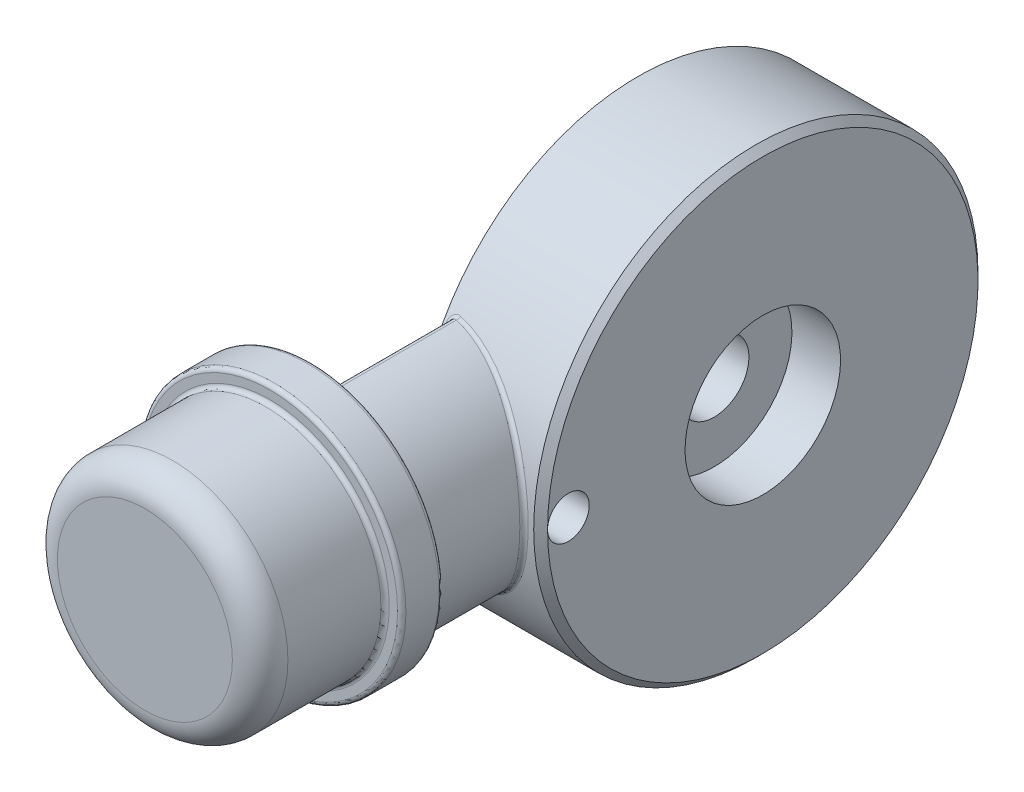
ISO-10303-21;
HEADER;
FILE_DESCRIPTION(('STEP AP214'),'2;1');
FILE_NAME('part.step','',(''),(''),'','','');
FILE_SCHEMA(('AUTOMOTIVE_DESIGN { 1 0 10303 214 1 1 1 1 }'));
ENDSEC;
DATA;
#1=APPLICATION_CONTEXT('core data for automotive mechanical design processes');
#2=APPLICATION_PROTOCOL_DEFINITION('international standard','automotive_design',2000,#1);
#3=PRODUCT_CONTEXT('',#1,'mechanical');
#4=PRODUCT('Part','Part','',(#3));
#5=PRODUCT_RELATED_PRODUCT_CATEGORY('part','',(#4));
#6=PRODUCT_DEFINITION_FORMATION('','',#4);
#7=PRODUCT_DEFINITION_CONTEXT('part definition',#1,'design');
#8=PRODUCT_DEFINITION('design','',#6,#7);
#9=PRODUCT_DEFINITION_SHAPE('','',#8);
#10=(LENGTH_UNIT() NAMED_UNIT(*) SI_UNIT(.MILLI.,.METRE.));
#11=(NAMED_UNIT(*) PLANE_ANGLE_UNIT() SI_UNIT($,.RADIAN.));
#12=(NAMED_UNIT(*) SI_UNIT($,.STERADIAN.) SOLID_ANGLE_UNIT());
#13=UNCERTAINTY_MEASURE_WITH_UNIT(LENGTH_MEASURE(1.E-05),#10,'distance_accuracy_value','');
#14=(GEOMETRIC_REPRESENTATION_CONTEXT(3) GLOBAL_UNCERTAINTY_ASSIGNED_CONTEXT((#13)) GLOBAL_UNIT_ASSIGNED_CONTEXT((#10,
#11,#12)) REPRESENTATION_CONTEXT('',''));
#15=CARTESIAN_POINT('',(0.,0.,0.));
#16=DIRECTION('',(0.,0.,1.));
#17=DIRECTION('',(1.,0.,0.));
#18=AXIS2_PLACEMENT_3D('',#15,#16,#17);
#19=CARTESIAN_POINT('',(9.50000000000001,0.,0.));
#20=DIRECTION('',(1.,0.,0.));
#21=DIRECTION('',(0.,0.,-1.));
#22=AXIS2_PLACEMENT_3D('',#19,#20,#21);
#23=CYLINDRICAL_SURFACE('',#22,2.49999999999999);
#24=CARTESIAN_POINT('',(-4.75,0.,0.));
#25=DIRECTION('',(-1.,0.,0.));
#26=DIRECTION('',(0.,-1.,0.));
#27=AXIS2_PLACEMENT_3D('',#24,#25,#26);
#28=CIRCLE('',#27,2.49999999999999);
#29=CARTESIAN_POINT('',(-4.75,-2.49999999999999,0.));
#30=VERTEX_POINT('',#29);
#31=EDGE_CURVE('E740',#30,#30,#28,.T.);
#32=ORIENTED_EDGE('',*,*,#31,.T.);
#33=EDGE_LOOP('',(#32));
#34=FACE_BOUND('',#33,.T.);
#35=CARTESIAN_POINT('',(6.00000000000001,0.,0.));
#36=DIRECTION('',(1.,0.,0.));
#37=DIRECTION('',(0.,1.,0.));
#38=AXIS2_PLACEMENT_3D('',#35,#36,#37);
#39=CIRCLE('',#38,2.49999999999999);
#40=CARTESIAN_POINT('',(6.00000000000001,2.49999999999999,0.));
#41=VERTEX_POINT('',#40);
#42=EDGE_CURVE('E52',#41,#41,#39,.F.);
#43=ORIENTED_EDGE('',*,*,#42,.F.);
#44=EDGE_LOOP('',(#43));
#45=FACE_BOUND('',#44,.T.);
#46=ADVANCED_FACE('F48',(#34,#45),#23,.F.);
#47=CARTESIAN_POINT('',(0.500000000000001,0.,0.));
#48=DIRECTION('',(-1.,0.,0.));
#49=DIRECTION('',(0.,-1.,0.));
#50=AXIS2_PLACEMENT_3D('',#47,#48,#49);
#51=PLANE('',#50);
#52=CARTESIAN_POINT('',(0.5,0.,14.));
#53=DIRECTION('',(-1.,0.,0.));
#54=DIRECTION('',(0.,-1.,0.));
#55=AXIS2_PLACEMENT_3D('',#52,#53,#54);
#56=CIRCLE('',#55,1.49999999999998);
#57=CARTESIAN_POINT('',(0.5,-1.49999999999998,14.));
#58=VERTEX_POINT('',#57);
#59=EDGE_CURVE('E180',#58,#58,#56,.T.);
#60=ORIENTED_EDGE('',*,*,#59,.F.);
#61=EDGE_LOOP('',(#60));
#62=FACE_BOUND('',#61,.T.);
#63=CARTESIAN_POINT('',(0.500000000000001,0.,0.));
#64=DIRECTION('',(-1.,0.,0.));
#65=DIRECTION('',(0.,-1.,0.));
#66=AXIS2_PLACEMENT_3D('',#63,#64,#65);
#67=CIRCLE('',#66,16.);
#68=CARTESIAN_POINT('',(0.500000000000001,-16.,0.));
#69=VERTEX_POINT('',#68);
#70=EDGE_CURVE('E192',#69,#69,#67,.T.);
#71=ORIENTED_EDGE('',*,*,#70,.T.);
#72=EDGE_LOOP('',(#71));
#73=FACE_BOUND('',#72,.T.);
#74=CARTESIAN_POINT('',(0.500000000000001,0.,0.));
#75=DIRECTION('',(-1.,0.,0.));
#76=DIRECTION('',(0.,-1.,0.));
#77=AXIS2_PLACEMENT_3D('',#74,#75,#76);
#78=CIRCLE('',#77,6.5);
#79=CARTESIAN_POINT('',(0.500000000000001,-6.5,0.));
#80=VERTEX_POINT('',#79);
#81=EDGE_CURVE('E186',#80,#80,#78,.T.);
#82=ORIENTED_EDGE('',*,*,#81,.F.);
#83=EDGE_LOOP('',(#82));
#84=FACE_BOUND('',#83,.T.);
#85=CARTESIAN_POINT('',(0.500000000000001,-11.2225955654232,0.784760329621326));
#86=DIRECTION('',(-1.,0.,0.));
#87=DIRECTION('',(0.,-1.,0.));
#88=AXIS2_PLACEMENT_3D('',#85,#86,#87);
#89=CIRCLE('',#88,3.);
#90=CARTESIAN_POINT('',(0.500000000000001,-14.2152877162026,0.994029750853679));
#91=VERTEX_POINT('',#90);
#92=CARTESIAN_POINT('',(0.5,-8.2299034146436,0.575490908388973));
#93=VERTEX_POINT('',#92);
#94=EDGE_CURVE('E150',#91,#93,#89,.T.);
#95=ORIENTED_EDGE('',*,*,#94,.F.);
#96=CARTESIAN_POINT('',(0.500000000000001,0.,0.));
#97=DIRECTION('',(-1.,0.,0.));
#98=DIRECTION('',(0.,-1.,0.));
#99=AXIS2_PLACEMENT_3D('',#96,#97,#98);
#100=CIRCLE('',#99,14.2500000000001);
#101=CARTESIAN_POINT('',(0.500000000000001,9.15972343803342,-10.9161333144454));
#102=VERTEX_POINT('',#101);
#103=EDGE_CURVE('E167',#102,#91,#100,.T.);
#104=ORIENTED_EDGE('',*,*,#103,.F.);
#105=CARTESIAN_POINT('',(0.500000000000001,7.23136060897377,-8.6179999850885));
#106=DIRECTION('',(-1.,0.,0.));
#107=DIRECTION('',(0.,-1.,0.));
#108=AXIS2_PLACEMENT_3D('',#105,#106,#107);
#109=CIRCLE('',#108,3.00000000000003);
#110=CARTESIAN_POINT('',(0.500000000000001,5.30299777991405,-6.31986665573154));
#111=VERTEX_POINT('',#110);
#112=EDGE_CURVE('E170',#111,#102,#109,.T.);
#113=ORIENTED_EDGE('',*,*,#112,.F.);
#114=CARTESIAN_POINT('',(0.500000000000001,0.,0.));
#115=DIRECTION('',(1.,0.,0.));
#116=DIRECTION('',(0.,1.,0.));
#117=AXIS2_PLACEMENT_3D('',#114,#115,#116);
#118=CIRCLE('',#117,8.25000000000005);
#119=EDGE_CURVE('E179',#93,#111,#118,.T.);
#120=ORIENTED_EDGE('',*,*,#119,.F.);
#121=EDGE_LOOP('',(#95,#104,#113,#120));
#122=FACE_BOUND('',#121,.T.);
#123=ADVANCED_FACE('F328',(#62,#73,#84,#122),#51,.T.);
#124=CARTESIAN_POINT('',(1.,8.23953882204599,26.));
#125=DIRECTION('',(1.,0.,0.));
#126=DIRECTION('',(0.,1.,0.));
#127=AXIS2_PLACEMENT_3D('',#124,#125,#126);
#128=PLANE('',#127);
#129=DIRECTION('',(0.,1.,0.));
#130=VECTOR('',#129,1.);
#131=CARTESIAN_POINT('',(1.,8.2395388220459,22.7));
#132=LINE('',#131,#130);
#133=CARTESIAN_POINT('',(1.,-7.89366834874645,22.7));
#134=VERTEX_POINT('',#133);
#135=CARTESIAN_POINT('',(1.,7.89366834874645,22.7));
#136=VERTEX_POINT('',#135);
#137=EDGE_CURVE('E607',#134,#136,#132,.T.);
#138=ORIENTED_EDGE('',*,*,#137,.T.);
#139=DIRECTION('',(0.,0.,1.));
#140=VECTOR('',#139,1.);
#141=CARTESIAN_POINT('',(1.,7.89366834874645,13.7153199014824));
#142=LINE('',#141,#140);
#143=CARTESIAN_POINT('',(1.,7.89366834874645,14.2611359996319));
#144=VERTEX_POINT('',#143);
#145=EDGE_CURVE('E602',#136,#144,#142,.F.);
#146=ORIENTED_EDGE('',*,*,#145,.T.);
#147=CARTESIAN_POINT('',(1.,0.,0.));
#148=DIRECTION('',(1.,0.,0.));
#149=DIRECTION('',(0.,1.,0.));
#150=AXIS2_PLACEMENT_3D('',#147,#148,#149);
#151=CIRCLE('',#150,16.3);
#152=CARTESIAN_POINT('',(1.,-7.89366834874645,14.2611359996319));
#153=VERTEX_POINT('',#152);
#154=EDGE_CURVE('E729',#144,#153,#151,.T.);
#155=ORIENTED_EDGE('',*,*,#154,.T.);
#156=DIRECTION('',(0.,0.,1.));
#157=VECTOR('',#156,1.);
#158=CARTESIAN_POINT('',(1.,-7.89366834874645,23.));
#159=LINE('',#158,#157);
#160=EDGE_CURVE('E739',#153,#134,#159,.T.);
#161=ORIENTED_EDGE('',*,*,#160,.T.);
#162=EDGE_LOOP('',(#138,#146,#155,#161));
#163=FACE_BOUND('',#162,.T.);
#164=ADVANCED_FACE('F232',(#163),#128,.F.);
#165=CARTESIAN_POINT('',(9.50000000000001,0.,0.));
#166=DIRECTION('',(-1.,0.,0.));
#167=DIRECTION('',(0.,-1.,0.));
#168=AXIS2_PLACEMENT_3D('',#165,#166,#167);
#169=CYLINDRICAL_SURFACE('',#168,16.);
#170=CARTESIAN_POINT('',(0.741610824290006,7.53287841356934,14.1157976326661));
#171=CARTESIAN_POINT('',(1.07891403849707,7.63610338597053,14.0607117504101));
#172=CARTESIAN_POINT('',(1.020805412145,7.78389411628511,14.3804688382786));
#173=CARTESIAN_POINT('',(0.727705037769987,7.5675963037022,14.097277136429));
#174=CARTESIAN_POINT('',(1.06266589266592,7.65022983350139,14.0528529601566));
#175=CARTESIAN_POINT('',(1.01385251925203,7.80157854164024,14.3616010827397));
#176=CARTESIAN_POINT('',(0.717306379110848,7.60323458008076,14.0780878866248));
#177=CARTESIAN_POINT('',(1.04735115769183,7.66714479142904,14.0435166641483));
#178=CARTESIAN_POINT('',(1.0086531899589,7.81973178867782,14.3420520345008));
#179=CARTESIAN_POINT('',(0.703450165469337,7.67540062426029,14.0388697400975));
#180=CARTESIAN_POINT('',(1.02064069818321,7.70499602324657,14.022635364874));
#181=CARTESIAN_POINT('',(1.00172508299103,7.85649136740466,14.3020985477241));
#182=CARTESIAN_POINT('',(0.700000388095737,7.7119293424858,14.0188399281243));
#183=CARTESIAN_POINT('',(1.00913010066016,7.72581160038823,14.0111566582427));
#184=CARTESIAN_POINT('',(1.00000019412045,7.87509818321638,14.2816931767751));
#185=CARTESIAN_POINT('',(0.699999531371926,7.79240788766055,13.9742950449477));
#186=CARTESIAN_POINT('',(0.989333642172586,7.77475907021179,13.984063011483));
#187=CARTESIAN_POINT('',(0.999999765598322,7.91609194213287,14.2363130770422));
#188=CARTESIAN_POINT('',(0.705028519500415,7.83632475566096,13.94971171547));
#189=CARTESIAN_POINT('',(0.981895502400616,7.80358555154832,13.96804781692));
#190=CARTESIAN_POINT('',(1.00251425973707,7.93846209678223,14.2112688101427));
#191=CARTESIAN_POINT('',(0.725009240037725,7.92234829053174,13.9010373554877));
#192=CARTESIAN_POINT('',(0.975497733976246,7.86302804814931,13.9347847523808));
#193=CARTESIAN_POINT('',(1.01250462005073,7.98228033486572,14.1616818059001));
#194=CARTESIAN_POINT('',(0.739979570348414,7.96445140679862,13.8769473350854));
#195=CARTESIAN_POINT('',(0.976275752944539,7.89365187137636,13.9175394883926));
#196=CARTESIAN_POINT('',(1.01998978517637,8.00372660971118,14.1371400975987));
#197=CARTESIAN_POINT('',(0.776736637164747,8.03909405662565,13.833819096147));
#198=CARTESIAN_POINT('',(0.986040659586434,7.94983072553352,13.8856585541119));
#199=CARTESIAN_POINT('',(1.03836831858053,8.041747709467,14.0932032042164));
#200=CARTESIAN_POINT('',(0.79720598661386,8.07213164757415,13.8145573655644));
#201=CARTESIAN_POINT('',(0.993631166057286,7.97544602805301,13.8710299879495));
#202=CARTESIAN_POINT('',(1.04860299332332,8.05857623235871,14.0735803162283));
#203=CARTESIAN_POINT('',(0.845010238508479,8.13428036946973,13.7780541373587));
#204=CARTESIAN_POINT('',(1.01528872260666,8.02451480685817,13.8428331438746));
#205=CARTESIAN_POINT('',(1.07250511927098,8.090233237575,14.0363926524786));
#206=CARTESIAN_POINT('',(0.872331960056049,8.16339887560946,13.7608088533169));
#207=CARTESIAN_POINT('',(1.02923779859,8.04808428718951,13.8292023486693));
#208=CARTESIAN_POINT('',(1.08616598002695,8.10506547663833,14.018824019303));
#209=CARTESIAN_POINT('',(0.926082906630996,8.20999568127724,13.7330450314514));
#210=CARTESIAN_POINT('',(1.05919848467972,8.08628490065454,13.8069935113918));
#211=CARTESIAN_POINT('',(1.11304145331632,8.12880072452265,13.9905396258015));
#212=CARTESIAN_POINT('',(0.951175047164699,8.22859461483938,13.7219026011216));
#213=CARTESIAN_POINT('',(1.07385758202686,8.10172202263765,13.7979783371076));
#214=CARTESIAN_POINT('',(1.12558752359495,8.13827455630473,13.9791882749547));
#215=CARTESIAN_POINT('',(1.00463606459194,8.26197692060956,13.7018289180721));
#216=CARTESIAN_POINT('',(1.10626891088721,8.12957750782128,13.7816575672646));
#217=CARTESIAN_POINT('',(1.1523180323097,8.15527866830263,13.9587382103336));
#218=CARTESIAN_POINT('',(1.03299727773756,8.27676896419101,13.6928926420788));
#219=CARTESIAN_POINT('',(1.12402007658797,8.14206837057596,13.7743102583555));
#220=CARTESIAN_POINT('',(1.16649863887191,8.16281336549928,13.9496343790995));
#221=CARTESIAN_POINT('',(1.09261699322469,8.30196785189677,13.6776295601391));
#222=CARTESIAN_POINT('',(1.16215408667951,8.1633931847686,13.761737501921));
#223=CARTESIAN_POINT('',(1.19630849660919,8.17564904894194,13.9340851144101));
#224=CARTESIAN_POINT('',(1.12389409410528,8.3123438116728,13.6713211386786));
#225=CARTESIAN_POINT('',(1.18259012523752,8.17226272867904,13.7564911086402));
#226=CARTESIAN_POINT('',(1.2119470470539,8.18093430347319,13.9276584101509));
#227=CARTESIAN_POINT('',(1.18821191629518,8.32794121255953,13.6618256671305));
#228=CARTESIAN_POINT('',(1.22506918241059,8.18558440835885,13.748601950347));
#229=CARTESIAN_POINT('',(1.24410595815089,8.18887922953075,13.9179848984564));
#230=CARTESIAN_POINT('',(1.2212507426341,8.33316807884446,13.6586353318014));
#231=CARTESIAN_POINT('',(1.24717076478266,8.19008402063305,13.7459311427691));
#232=CARTESIAN_POINT('',(1.26062537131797,8.19154166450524,13.9147347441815));
#233=CARTESIAN_POINT('',(1.28440783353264,8.33787730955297,13.6557609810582));
#234=CARTESIAN_POINT('',(1.28950310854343,8.19412519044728,13.7435324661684));
#235=CARTESIAN_POINT('',(1.29220391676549,8.19394042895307,13.9118064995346));
#236=CARTESIAN_POINT('',(1.31446966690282,8.33790387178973,13.6557447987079));
#237=CARTESIAN_POINT('',(1.30974172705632,8.19414769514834,13.7435191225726));
#238=CARTESIAN_POINT('',(1.30723483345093,8.19395395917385,13.9117900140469));
#239=CARTESIAN_POINT('',(1.37416737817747,8.33356475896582,13.6583931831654));
#240=CARTESIAN_POINT('',(1.34975700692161,8.19042512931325,13.7457286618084));
#241=CARTESIAN_POINT('',(1.33708368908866,8.1917437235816,13.9144880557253));
#242=CARTESIAN_POINT('',(1.40380285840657,8.32919522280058,13.6610601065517));
#243=CARTESIAN_POINT('',(1.36958751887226,8.18666652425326,13.7479595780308));
#244=CARTESIAN_POINT('',(1.35190142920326,8.18951799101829,13.9172049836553));
#245=CARTESIAN_POINT('',(1.46076933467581,8.31650568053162,13.6687888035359));
#246=CARTESIAN_POINT('',(1.40730064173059,8.17581947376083,13.7543857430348));
#247=CARTESIAN_POINT('',(1.38038466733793,8.18305425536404,13.9250785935));
#248=CARTESIAN_POINT('',(1.48814419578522,8.30832192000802,13.6737679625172));
#249=CARTESIAN_POINT('',(1.4252700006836,8.16881889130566,13.7585291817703));
#250=CARTESIAN_POINT('',(1.39407209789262,8.17888565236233,13.9301511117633));
#251=CARTESIAN_POINT('',(1.54099819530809,8.28846623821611,13.6858121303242));
#252=CARTESIAN_POINT('',(1.45942398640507,8.1519735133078,13.7684737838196));
#253=CARTESIAN_POINT('',(1.42049909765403,8.16877166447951,13.9424211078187));
#254=CARTESIAN_POINT('',(1.5664801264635,8.27679958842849,13.6928739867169));
#255=CARTESIAN_POINT('',(1.47563862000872,8.1420960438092,13.7742941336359));
#256=CARTESIAN_POINT('',(1.43324006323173,8.16282896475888,13.9496153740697));
#257=CARTESIAN_POINT('',(1.59073693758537,8.26358051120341,13.7008480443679));
#258=CARTESIAN_POINT('',(1.49060637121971,8.13103648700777,13.7807911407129));
#259=CARTESIAN_POINT('',(1.44536846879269,8.15609549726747,13.9577389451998));
#260=(BOUNDED_SURFACE() B_SPLINE_SURFACE(3,2,((#170,#171,#172),(#173,#174,#175),(#176,#177,
#178),(#179,#180,#181),(#182,#183,#184),(#185,#186,#187),(#188,#189,#190),(#191,#192,#193),
(#194,#195,#196),(#197,#198,#199),(#200,#201,#202),(#203,#204,#205),(#206,#207,#208),(#209,#210,
#211),(#212,#213,#214),(#215,#216,#217),(#218,#219,#220),(#221,#222,#223),(#224,#225,#226),
(#227,#228,#229),(#230,#231,#232),(#233,#234,#235),(#236,#237,#238),(#239,#240,#241),(#242,#243,
#244),(#245,#246,#247),(#248,#249,#250),(#251,#252,#253),(#254,#255,#256),(#257,#258,#259)),
.UNSPECIFIED.,.F.,.F.,.F.) B_SPLINE_SURFACE_WITH_KNOTS((4,2,2,2,2,2,2,2,2,2,2,2,2,2,4),(3,3),
(0.,0.127033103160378,0.254208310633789,0.407773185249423,0.561626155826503,0.692974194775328,
0.824071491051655,0.923947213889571,1.02359338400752,1.12392542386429,1.22415163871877,
1.3138831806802,1.40369360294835,1.49051652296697,1.57720869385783),(0.,1.),
.UNSPECIFIED.) GEOMETRIC_REPRESENTATION_ITEM() RATIONAL_B_SPLINE_SURFACE(((1.,0.643321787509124,
1.),(1.,0.653801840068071,1.),(1.,0.664445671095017,1.),(1.,0.685798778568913,1.),(1.,
0.696508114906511,1.),(1.,0.719904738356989,1.),(1.,0.732541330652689,1.),(1.,0.757085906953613,
1.),(1.,0.76899247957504,1.),(1.,0.789957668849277,1.),(1.,0.799178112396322,1.),(1.,
0.816441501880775,1.),(1.,0.824486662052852,1.),(1.,0.837314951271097,1.),(1.,0.842418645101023,
1.),(1.,0.851559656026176,1.),(1.,0.85559939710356,1.),(1.,0.862471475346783,1.),(1.,
0.865295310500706,1.),(1.,0.869537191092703,1.),(1.,0.870956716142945,1.),(1.,0.872235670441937,
1.),(1.,0.872242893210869,1.),(1.,0.871064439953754,1.),(1.,0.86987771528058,1.),(1.,
0.866427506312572,1.),(1.,0.864201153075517,1.),(1.,0.858790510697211,1.),(1.,0.855607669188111,
1.),(1.,0.851994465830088,1.))) REPRESENTATION_ITEM('') SURFACE());
#261=CARTESIAN_POINT('',(1.59073693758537,8.26358051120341,13.7008480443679));
#262=CARTESIAN_POINT('',(1.5664801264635,8.27679958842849,13.6928739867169));
#263=CARTESIAN_POINT('',(1.54099819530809,8.28846623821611,13.6858121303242));
#264=CARTESIAN_POINT('',(1.48814419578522,8.30832192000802,13.6737679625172));
#265=CARTESIAN_POINT('',(1.46076933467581,8.31650568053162,13.6687888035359));
#266=CARTESIAN_POINT('',(1.40380285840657,8.32919522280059,13.6610601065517));
#267=CARTESIAN_POINT('',(1.37416737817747,8.33356475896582,13.6583931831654));
#268=CARTESIAN_POINT('',(1.31446966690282,8.33790387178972,13.6557447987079));
#269=CARTESIAN_POINT('',(1.28440783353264,8.33787730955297,13.6557609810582));
#270=CARTESIAN_POINT('',(1.2212507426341,8.33316807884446,13.6586353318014));
#271=CARTESIAN_POINT('',(1.18821191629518,8.32794121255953,13.6618256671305));
#272=CARTESIAN_POINT('',(1.12389409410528,8.3123438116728,13.6713211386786));
#273=CARTESIAN_POINT('',(1.09261699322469,8.30196785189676,13.6776295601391));
#274=CARTESIAN_POINT('',(1.03299727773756,8.27676896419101,13.6928926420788));
#275=CARTESIAN_POINT('',(1.00463606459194,8.26197692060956,13.7018289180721));
#276=CARTESIAN_POINT('',(0.951175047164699,8.22859461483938,13.7219026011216));
#277=CARTESIAN_POINT('',(0.926082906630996,8.20999568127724,13.7330450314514));
#278=CARTESIAN_POINT('',(0.872331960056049,8.16339887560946,13.7608088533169));
#279=CARTESIAN_POINT('',(0.845010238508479,8.13428036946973,13.7780541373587));
#280=CARTESIAN_POINT('',(0.79720598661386,8.07213164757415,13.8145573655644));
#281=CARTESIAN_POINT('',(0.776736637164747,8.03909405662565,13.833819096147));
#282=CARTESIAN_POINT('',(0.739979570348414,7.96445140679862,13.8769473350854));
#283=CARTESIAN_POINT('',(0.725009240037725,7.92234829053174,13.9010373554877));
#284=CARTESIAN_POINT('',(0.705028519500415,7.83632475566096,13.9497117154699));
#285=CARTESIAN_POINT('',(0.699999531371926,7.79240788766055,13.9742950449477));
#286=CARTESIAN_POINT('',(0.700000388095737,7.7119293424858,14.0188399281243));
#287=CARTESIAN_POINT('',(0.703450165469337,7.67540062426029,14.0388697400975));
#288=CARTESIAN_POINT('',(0.717306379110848,7.60323458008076,14.0780878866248));
#289=CARTESIAN_POINT('',(0.727705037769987,7.5675963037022,14.097277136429));
#290=CARTESIAN_POINT('',(0.741610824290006,7.53287841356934,14.1157976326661));
#291=B_SPLINE_CURVE_WITH_KNOTS('',3,(#261,#262,#263,#264,#265,#266,#267,#268,#269,#270,#271,
#272,#273,#274,#275,#276,#277,#278,#279,#280,#281,#282,#283,#284,#285,#286,#287,#288,#289,#290),
.UNSPECIFIED.,.F.,.F.,(4,2,2,2,2,2,2,2,2,2,2,2,2,2,4),(0.,0.08669217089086,0.173515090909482,
0.263325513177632,0.353057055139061,0.453283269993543,0.553615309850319,0.653261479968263,
0.753137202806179,0.884234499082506,1.01558253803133,1.16943550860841,1.32300038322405,
1.45017559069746,1.57720869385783),.UNSPECIFIED.);
#292=CARTESIAN_POINT('',(1.3975,8.32951506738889,13.6608630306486));
#293=VERTEX_POINT('',#292);
#294=CARTESIAN_POINT('',(0.700000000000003,7.74838610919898,13.9986611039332));
#295=VERTEX_POINT('',#294);
#296=EDGE_CURVE('E616',#293,#295,#291,.T.);
#297=ORIENTED_EDGE('',*,*,#296,.F.);
#298=CARTESIAN_POINT('',(-1.73460559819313,8.26822102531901,13.6980480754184));
#299=CARTESIAN_POINT('',(-1.69443046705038,8.12522839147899,13.7843592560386));
#300=CARTESIAN_POINT('',(-1.67409610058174,8.12941586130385,13.9548864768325));
#301=CARTESIAN_POINT('',(-1.5288495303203,8.30984769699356,13.6728885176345));
#302=CARTESIAN_POINT('',(-1.49393517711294,8.16710198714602,13.7596441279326));
#303=CARTESIAN_POINT('',(-1.4755175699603,8.17034371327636,13.9292551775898));
#304=CARTESIAN_POINT('',(-1.32098218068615,8.34411747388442,13.651975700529));
#305=CARTESIAN_POINT('',(-1.29081460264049,8.20164155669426,13.7390573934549));
#306=CARTESIAN_POINT('',(-1.27490140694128,8.20403817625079,13.9079502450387));
#307=CARTESIAN_POINT('',(-0.902518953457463,8.39764919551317,13.6191307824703));
#308=CARTESIAN_POINT('',(-0.882063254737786,8.25555496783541,13.7067462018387));
#309=CARTESIAN_POINT('',(-0.871035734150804,8.25667121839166,13.8744894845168));
#310=CARTESIAN_POINT('',(-0.691922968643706,8.41691054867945,13.6071990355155));
#311=CARTESIAN_POINT('',(-0.676190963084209,8.27499383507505,13.6949832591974));
#312=CARTESIAN_POINT('',(-0.667786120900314,8.27560921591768,13.8623340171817));
#313=CARTESIAN_POINT('',(-0.270435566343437,8.44007734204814,13.5928369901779));
#314=CARTESIAN_POINT('',(-0.264362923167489,8.2983429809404,13.6808429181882));
#315=CARTESIAN_POINT('',(-0.261001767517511,8.29838709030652,13.8477026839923));
#316=CARTESIAN_POINT('',(-0.0595494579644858,8.44404949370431,13.5903654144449));
#317=CARTESIAN_POINT('',(-0.0581580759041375,8.30234969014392,13.6784072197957));
#318=CARTESIAN_POINT('',(-0.057472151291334,8.30229255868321,13.8451847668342));
#319=CARTESIAN_POINT('',(0.361821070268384,8.43677872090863,13.5948812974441));
#320=CARTESIAN_POINT('',(0.353587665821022,8.29502162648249,13.6828535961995));
#321=CARTESIAN_POINT('',(0.349199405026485,8.29514384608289,13.8497853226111));
#322=CARTESIAN_POINT('',(0.572305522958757,8.42553709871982,13.6018679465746));
#323=CARTESIAN_POINT('',(0.559384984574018,8.28367903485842,13.6897404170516));
#324=CARTESIAN_POINT('',(0.552341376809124,8.28409094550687,13.8569029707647));
#325=CARTESIAN_POINT('',(0.991476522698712,8.38797442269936,13.6250641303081));
#326=CARTESIAN_POINT('',(0.968899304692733,8.24583098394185,13.7125713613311));
#327=CARTESIAN_POINT('',(0.956890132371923,8.24715886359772,13.8805340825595));
#328=CARTESIAN_POINT('',(1.20016188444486,8.36164409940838,13.641279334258));
#329=CARTESIAN_POINT('',(1.17286313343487,8.21926962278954,13.7285490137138));
#330=CARTESIAN_POINT('',(1.15829577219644,8.22127056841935,13.8970533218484));
#331=CARTESIAN_POINT('',(1.61417957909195,8.29424822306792,13.6823597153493));
#332=CARTESIAN_POINT('',(1.5771665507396,8.1513894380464,13.7689606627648));
#333=CARTESIAN_POINT('',(1.55787098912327,8.15500612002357,13.938903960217));
#334=CARTESIAN_POINT('',(1.81951056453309,8.25317689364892,13.7072282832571));
#335=CARTESIAN_POINT('',(1.77773332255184,8.10998409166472,13.7934451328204));
#336=CARTESIAN_POINT('',(1.75603926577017,8.11462428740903,13.9642388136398));
#337=CARTESIAN_POINT('',(2.42847663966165,8.10851022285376,13.7936551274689));
#338=CARTESIAN_POINT('',(2.37310655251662,7.96406099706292,13.878564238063));
#339=CARTESIAN_POINT('',(2.34376233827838,7.97238625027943,14.0522861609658));
#340=CARTESIAN_POINT('',(2.82530684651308,7.98344171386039,13.8670481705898));
#341=CARTESIAN_POINT('',(2.76069562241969,7.8376939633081,13.9509320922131));
#342=CARTESIAN_POINT('',(2.72674963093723,7.84941736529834,14.1270553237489));
#343=CARTESIAN_POINT('',(3.6037083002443,7.67624466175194,14.0394785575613));
#344=CARTESIAN_POINT('',(3.51871067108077,7.52899473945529,14.1199839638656));
#345=CARTESIAN_POINT('',(3.47799754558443,7.54737747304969,14.3027187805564));
#346=CARTESIAN_POINT('',(3.98441909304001,7.49245995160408,14.1392435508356));
#347=CARTESIAN_POINT('',(3.88921141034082,7.34380725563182,14.2179474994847));
#348=CARTESIAN_POINT('',(3.84542772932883,7.36667810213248,14.404354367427));
#349=CARTESIAN_POINT('',(4.71163742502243,7.07417974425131,14.3530888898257));
#350=CARTESIAN_POINT('',(4.59474991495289,6.92476994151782,14.4267245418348));
#351=CARTESIAN_POINT('',(4.54727797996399,6.95541989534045,14.6222093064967));
#352=CARTESIAN_POINT('',(5.05810304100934,6.83962318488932,14.4671864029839));
#353=CARTESIAN_POINT('',(4.93019540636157,6.68944210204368,14.5380724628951));
#354=CARTESIAN_POINT('',(4.88165758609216,6.7248010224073,14.7384461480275));
#355=CARTESIAN_POINT('',(5.75922621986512,6.28695452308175,14.7166213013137));
#356=CARTESIAN_POINT('',(5.60797851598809,6.13730188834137,14.7805359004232));
#357=CARTESIAN_POINT('',(5.55832297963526,6.18141044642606,14.9925579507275));
#358=CARTESIAN_POINT('',(6.10776333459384,5.96165442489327,14.8526365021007));
#359=CARTESIAN_POINT('',(5.94286183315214,5.81265820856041,14.9121555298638));
#360=CARTESIAN_POINT('',(5.89470182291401,5.86157141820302,15.1311234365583));
#361=CARTESIAN_POINT('',(6.74572024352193,5.25725017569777,15.1162837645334));
#362=CARTESIAN_POINT('',(6.5542156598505,5.11434586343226,15.1659476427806));
#363=CARTESIAN_POINT('',(6.51040442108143,5.16899256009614,15.3997140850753));
#364=CARTESIAN_POINT('',(7.03526434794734,4.878262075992,15.2439330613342));
#365=CARTESIAN_POINT('',(6.82944899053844,4.73953586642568,15.2879332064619));
#366=CARTESIAN_POINT('',(6.78984814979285,4.79636683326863,15.5297568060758));
#367=CARTESIAN_POINT('',(7.3963428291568,4.3115768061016,15.4090847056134));
#368=CARTESIAN_POINT('',(7.17004526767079,4.18578459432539,15.4442523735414));
#369=CARTESIAN_POINT('',(7.138330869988,4.23919495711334,15.6980050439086));
#370=CARTESIAN_POINT('',(7.49567426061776,4.1430231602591,15.4553202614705));
#371=CARTESIAN_POINT('',(7.26408211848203,4.02028916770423,15.4881633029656));
#372=CARTESIAN_POINT('',(7.23419725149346,4.07347095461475,15.7451075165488));
#373=CARTESIAN_POINT('',(7.68267621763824,3.79866210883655,15.5435447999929));
#374=CARTESIAN_POINT('',(7.44094180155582,3.68270487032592,15.5718399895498));
#375=CARTESIAN_POINT('',(7.41467588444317,3.73489096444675,15.8349862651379));
#376=CARTESIAN_POINT('',(7.77034357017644,3.62285274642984,15.5855326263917));
#377=CARTESIAN_POINT('',(7.52359822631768,3.51066977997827,15.6115379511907));
#378=CARTESIAN_POINT('',(7.49928507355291,3.56203305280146,15.8777613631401));
#379=CARTESIAN_POINT('',(8.02762366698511,3.05756575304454,15.710096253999));
#380=CARTESIAN_POINT('',(7.76714886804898,2.95579482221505,15.729729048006));
#381=CARTESIAN_POINT('',(7.74759028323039,3.00623597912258,16.0046605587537));
#382=CARTESIAN_POINT('',(8.17491231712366,2.65586821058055,15.783528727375));
#383=CARTESIAN_POINT('',(7.90435441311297,2.56561645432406,15.798285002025));
#384=CARTESIAN_POINT('',(7.88974095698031,2.61128205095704,16.0794698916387));
#385=CARTESIAN_POINT('',(8.40665271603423,1.8307517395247,15.900382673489));
#386=CARTESIAN_POINT('',(8.12099221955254,1.7650197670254,15.9076883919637));
#387=CARTESIAN_POINT('',(8.11339738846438,1.80001746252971,16.1985148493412));
#388=CARTESIAN_POINT('',(8.49103896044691,1.40731065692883,15.9437728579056));
#389=CARTESIAN_POINT('',(8.19888479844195,1.35691792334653,15.9477794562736));
#390=CARTESIAN_POINT('',(8.19483992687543,1.38368502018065,16.2427185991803));
#391=CARTESIAN_POINT('',(8.59301032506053,0.549798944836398,15.9963229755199));
#392=CARTESIAN_POINT('',(8.29369703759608,0.528834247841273,15.9966831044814));
#393=CARTESIAN_POINT('',(8.29325415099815,0.540569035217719,16.2962540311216));
#394=CARTESIAN_POINT('',(8.61048411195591,0.115711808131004,16.0054258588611));
#395=CARTESIAN_POINT('',(8.30975355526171,0.112103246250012,16.0050518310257));
#396=CARTESIAN_POINT('',(8.31011838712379,0.113769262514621,16.3055275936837));
#397=CARTESIAN_POINT('',(8.57740790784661,-0.749101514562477,15.9883050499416));
#398=CARTESIAN_POINT('',(8.27903684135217,-0.722164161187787,15.9891403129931));
#399=CARTESIAN_POINT('',(8.27819600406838,-0.736525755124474,16.2880857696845));
#400=CARTESIAN_POINT('',(8.5268761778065,-1.17982857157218,15.9620908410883));
#401=CARTESIAN_POINT('',(8.23253544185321,-1.13621374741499,15.9650011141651));
#402=CARTESIAN_POINT('',(8.22942700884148,-1.16002185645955,16.2613800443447));
#403=CARTESIAN_POINT('',(8.36249246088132,-2.01440757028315,15.8780876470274));
#404=CARTESIAN_POINT('',(8.07933415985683,-1.94379646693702,15.8866239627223));
#405=CARTESIAN_POINT('',(8.07077760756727,-1.98059011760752,16.1758017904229));
#406=CARTESIAN_POINT('',(8.25031703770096,-2.41866682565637,15.8211353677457));
#407=CARTESIAN_POINT('',(7.97533887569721,-2.33478685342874,15.8337454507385));
#408=CARTESIAN_POINT('',(7.96251528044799,-2.37806275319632,16.1177816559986));
#409=CARTESIAN_POINT('',(7.96839103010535,-3.20249801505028,15.6812852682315));
#410=CARTESIAN_POINT('',(7.71089788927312,-3.09759916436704,15.7023239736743));
#411=CARTESIAN_POINT('',(7.69042390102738,-3.14873514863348,15.9753093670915));
#412=CARTESIAN_POINT('',(7.79862680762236,-3.58206407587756,15.5983813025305));
#413=CARTESIAN_POINT('',(7.55196360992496,-3.46777746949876,15.6244964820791));
#414=CARTESIAN_POINT('',(7.5265816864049,-3.52192913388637,15.8908509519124));
#415=CARTESIAN_POINT('',(7.39476582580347,-4.33190080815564,15.4075812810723));
#416=CARTESIAN_POINT('',(7.17023457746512,-4.20235550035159,15.4436356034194));
#417=CARTESIAN_POINT('',(7.13680887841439,-4.25917776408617,15.6964734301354));
#418=CARTESIAN_POINT('',(7.15730952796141,-4.70010534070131,15.2984464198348));
#419=CARTESIAN_POINT('',(6.9456118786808,-4.56477464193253,15.3399519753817));
#420=CARTESIAN_POINT('',(6.90763593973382,-4.62120095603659,15.5852922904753));
#421=CARTESIAN_POINT('',(6.62995463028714,-5.39417432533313,15.0677439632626));
#422=CARTESIAN_POINT('',(6.44250403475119,-5.25025090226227,15.1189922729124));
#423=CARTESIAN_POINT('',(6.39867714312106,-5.3036180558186,15.3502641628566));
#424=CARTESIAN_POINT('',(6.34001610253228,-5.7200062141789,14.9461669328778));
#425=CARTESIAN_POINT('',(6.16538988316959,-5.57376446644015,15.0021108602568));
#426=CARTESIAN_POINT('',(6.11885275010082,-5.62397994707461,15.2264075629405));
#427=CARTESIAN_POINT('',(5.67933396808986,-6.35710606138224,14.6873379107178));
#428=CARTESIAN_POINT('',(5.53092907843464,-6.2064294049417,14.7523113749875));
#429=CARTESIAN_POINT('',(5.48121766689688,-6.25038429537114,14.9627254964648));
#430=CARTESIAN_POINT('',(5.30322811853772,-6.66291899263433,14.5498213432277));
#431=CARTESIAN_POINT('',(5.16828925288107,-6.51255357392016,14.6186780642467));
#432=CARTESIAN_POINT('',(5.11823178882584,-6.551063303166,14.8226304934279));
#433=CARTESIAN_POINT('',(4.50034986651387,-7.2095536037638,14.2868654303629));
#434=CARTESIAN_POINT('',(4.39116761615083,-7.05906688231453,14.3626683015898));
#435=CARTESIAN_POINT('',(4.34336091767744,-7.08852112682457,14.5547441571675));
#436=CARTESIAN_POINT('',(4.07357540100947,-7.45037263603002,14.1614265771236));
#437=CARTESIAN_POINT('',(3.97653460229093,-7.30163234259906,14.2396680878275));
#438=CARTESIAN_POINT('',(3.93147393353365,-7.32529733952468,14.4269533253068));
#439=CARTESIAN_POINT('',(3.39902013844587,-7.75830212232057,13.9936668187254));
#440=CARTESIAN_POINT('',(3.31797378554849,-7.61196834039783,14.074791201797));
#441=CARTESIAN_POINT('',(3.28044966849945,-7.6280573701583,14.2560480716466));
#442=CARTESIAN_POINT('',(3.16649214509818,-7.85258070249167,13.9408179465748));
#443=CARTESIAN_POINT('',(3.09148487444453,-7.70683018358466,14.0229156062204));
#444=CARTESIAN_POINT('',(3.05603311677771,-7.72075322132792,14.2022082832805));
#445=CARTESIAN_POINT('',(2.69217411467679,-8.02124237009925,13.8444612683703));
#446=CARTESIAN_POINT('',(2.62937240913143,-7.87638447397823,13.9283812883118));
#447=CARTESIAN_POINT('',(2.59826106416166,-7.8865834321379,14.1040449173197));
#448=CARTESIAN_POINT('',(2.45038935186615,-8.09563659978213,13.8009482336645));
#449=CARTESIAN_POINT('',(2.3934857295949,-7.95134445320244,13.8855881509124));
#450=CARTESIAN_POINT('',(2.36491065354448,-7.95972874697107,14.0597160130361));
#451=CARTESIAN_POINT('',(1.95962238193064,-8.22341639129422,13.7251940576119));
#452=CARTESIAN_POINT('',(1.91471919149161,-8.07994169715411,13.8111539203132));
#453=CARTESIAN_POINT('',(1.89126346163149,-8.08536339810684,13.9825414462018));
#454=CARTESIAN_POINT('',(1.71064852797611,-8.27682535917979,13.6929403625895));
#455=CARTESIAN_POINT('',(1.6715021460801,-8.13381460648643,13.7793838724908));
#456=CARTESIAN_POINT('',(1.65097474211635,-8.13787574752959,13.9496829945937));
#457=CARTESIAN_POINT('',(1.20753083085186,-8.36184062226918,13.6411920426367));
#458=CARTESIAN_POINT('',(1.1802203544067,-8.21943906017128,13.7284808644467));
#459=CARTESIAN_POINT('',(1.1654076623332,-8.22146379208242,13.8969643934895));
#460=CARTESIAN_POINT('',(0.953388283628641,-8.39345231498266,13.6216942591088));
#461=CARTESIAN_POINT('',(0.931747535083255,-8.2513466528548,13.7092570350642));
#462=CARTESIAN_POINT('',(0.920130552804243,-8.25254479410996,13.8771010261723));
#463=CARTESIAN_POINT('',(0.477657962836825,-8.43148092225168,13.5981815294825));
#464=CARTESIAN_POINT('',(0.466904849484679,-8.28967098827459,13.6861099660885));
#465=CARTESIAN_POINT('',(0.460995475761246,-8.28993498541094,13.8531474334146));
#466=CARTESIAN_POINT('',(0.256392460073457,-8.44076165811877,13.5924080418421));
#467=CARTESIAN_POINT('',(0.250545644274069,-8.29903600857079,13.6804183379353));
#468=CARTESIAN_POINT('',(0.247448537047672,-8.29905991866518,13.8472656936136));
#469=CARTESIAN_POINT('',(-0.186245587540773,-8.44253351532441,13.5913066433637));
#470=CARTESIAN_POINT('',(-0.181984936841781,-8.30082242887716,13.6793335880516));
#471=CARTESIAN_POINT('',(-0.179748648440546,-8.30080203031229,13.8461436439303));
#472=CARTESIAN_POINT('',(-0.407618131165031,-8.43502482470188,13.5959786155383));
#473=CARTESIAN_POINT('',(-0.398453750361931,-8.29324647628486,13.683938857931));
#474=CARTESIAN_POINT('',(-0.393398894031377,-8.29341939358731,13.8509032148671));
#475=CARTESIAN_POINT('',(-0.849835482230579,-8.40323150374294,13.6156572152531));
#476=CARTESIAN_POINT('',(-0.830512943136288,-8.2612052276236,13.7033118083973));
#477=CARTESIAN_POINT('',(-0.820190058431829,-8.26215981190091,13.8709507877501));
#478=CARTESIAN_POINT('',(-1.0706707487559,-8.37885516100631,13.6307203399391));
#479=CARTESIAN_POINT('',(-1.04638563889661,-8.23660347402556,13.7181616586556));
#480=CARTESIAN_POINT('',(-1.03332176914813,-8.23819269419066,13.8862963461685));
#481=CARTESIAN_POINT('',(-1.508886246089,-8.31362714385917,13.6705806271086));
#482=CARTESIAN_POINT('',(-1.47437351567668,-8.17091720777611,13.7573684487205));
#483=CARTESIAN_POINT('',(-1.45625067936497,-8.17405971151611,13.9269040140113));
#484=CARTESIAN_POINT('',(-1.72626642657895,-8.27277522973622,13.69537793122));
#485=CARTESIAN_POINT('',(-1.68676223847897,-8.12974497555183,13.7817768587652));
#486=CARTESIAN_POINT('',(-1.66604783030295,-8.13389361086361,13.9521662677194));
#487=CARTESIAN_POINT('',(-1.94106592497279,-8.22388446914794,13.7247121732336));
#488=CARTESIAN_POINT('',(-1.89594680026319,-8.0805893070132,13.8105750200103));
#489=CARTESIAN_POINT('',(-1.87335432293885,-8.08582361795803,13.9820505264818));
#490=(BOUNDED_SURFACE() B_SPLINE_SURFACE(3,2,((#298,#299,#300),(#301,#302,#303),(#304,#305,
#306),(#307,#308,#309),(#310,#311,#312),(#313,#314,#315),(#316,#317,#318),(#319,#320,#321),
(#322,#323,#324),(#325,#326,#327),(#328,#329,#330),(#331,#332,#333),(#334,#335,#336),(#337,#338,
#339),(#340,#341,#342),(#343,#344,#345),(#346,#347,#348),(#349,#350,#351),(#352,#353,#354),
(#355,#356,#357),(#358,#359,#360),(#361,#362,#363),(#364,#365,#366),(#367,#368,#369),(#370,#371,
#372),(#373,#374,#375),(#376,#377,#378),(#379,#380,#381),(#382,#383,#384),(#385,#386,#387),
(#388,#389,#390),(#391,#392,#393),(#394,#395,#396),(#397,#398,#399),(#400,#401,#402),(#403,#404,
#405),(#406,#407,#408),(#409,#410,#411),(#412,#413,#414),(#415,#416,#417),(#418,#419,#420),
(#421,#422,#423),(#424,#425,#426),(#427,#428,#429),(#430,#431,#432),(#433,#434,#435),(#436,#437,
#438),(#439,#440,#441),(#442,#443,#444),(#445,#446,#447),(#448,#449,#450),(#451,#452,#453),
(#454,#455,#456),(#457,#458,#459),(#460,#461,#462),(#463,#464,#465),(#466,#467,#468),(#469,#470,
#471),(#472,#473,#474),(#475,#476,#477),(#478,#479,#480),(#481,#482,#483),(#484,#485,#486),
(#487,#488,#489)),.UNSPECIFIED.,.F.,.F.,.F.) B_SPLINE_SURFACE_WITH_KNOTS((4,2,2,2,2,2,2,2,2,2,2,
2,2,2,2,2,2,2,2,2,2,2,2,2,2,2,2,2,2,2,2,4),(3,3),(0.,0.634771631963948,1.26956828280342,
1.90159196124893,2.53356154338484,3.16591978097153,3.79852608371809,5.06307669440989,
6.36702071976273,7.67254176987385,9.16770032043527,10.6596749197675,11.2709217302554,
11.8823344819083,13.2000333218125,14.5191024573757,15.8403653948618,17.1612736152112,
18.4479167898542,19.7348648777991,21.1023038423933,22.4707875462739,23.9883776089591,
25.5060294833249,26.2769276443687,27.0473929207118,27.8169963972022,28.5864092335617,
29.25015841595,29.9139001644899,30.5812794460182,31.2486684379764),(0.,1.),
.UNSPECIFIED.) GEOMETRIC_REPRESENTATION_ITEM() RATIONAL_B_SPLINE_SURFACE(((1.,0.867796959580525,
1.),(1.,0.869266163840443,1.),(1.,0.870481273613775,1.),(1.,0.872384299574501,1.),(1.,
0.87307219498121,1.),(1.,0.873899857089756,1.),(1.,0.874042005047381,1.),(1.,0.873782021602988,
1.),(1.,0.873379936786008,1.),(1.,0.872040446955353,1.),(1.,0.87110271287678,1.),(1.,
0.868714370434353,1.),(1.,0.867263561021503,1.),(1.,0.862186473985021,1.),(1.,0.857834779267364,
1.),(1.,0.847389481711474,1.),(1.,0.841245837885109,1.),(1.,0.827731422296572,1.),(1.,
0.820359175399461,1.),(1.,0.803787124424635,1.),(1.,0.794477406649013,1.),(1.,0.77585038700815,
1.),(1.,0.766533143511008,1.),(1.,0.754141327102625,1.),(1.,0.75062838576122,1.),(1.,
0.743853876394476,1.),(1.,0.740592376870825,1.),(1.,0.73082266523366,1.),(1.,0.724916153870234,
1.),(1.,0.715402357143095,1.),(1.,0.711797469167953,1.),(1.,0.7074203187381,1.),(1.,
0.706652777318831,1.),(1.,0.70808575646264,1.),(1.,0.710285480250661,1.),(1.,0.71721940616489,
1.),(1.,0.721886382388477,1.),(1.,0.73309447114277,1.),(1.,0.739636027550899,1.),(1.,
0.754301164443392,1.),(1.,0.762498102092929,1.),(1.,0.779318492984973,1.),(1.,0.787942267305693,
1.),(1.,0.805775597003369,1.),(1.,0.814946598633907,1.),(1.,0.831991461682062,1.),(1.,
0.839865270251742,1.),(1.,0.850171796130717,1.),(1.,0.85337545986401,1.),(1.,0.859162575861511,
1.),(1.,0.861746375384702,1.),(1.,0.866213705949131,1.),(1.,0.868098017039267,1.),(1.,
0.871108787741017,1.),(1.,0.872235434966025,1.),(1.,0.873592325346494,1.),(1.,0.873924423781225,
1.),(1.,0.873987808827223,1.),(1.,0.873719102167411,1.),(1.,0.872584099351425,1.),(1.,
0.871714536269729,1.),(1.,0.869400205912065,1.),(1.,0.867955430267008,1.),(1.,0.866235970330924,1.))) REPRESENTATION_ITEM('') SURFACE());
#491=CARTESIAN_POINT('',(-1.73460559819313,8.26822102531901,13.6980480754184));
#492=CARTESIAN_POINT('',(-1.5288495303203,8.30984769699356,13.6728885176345));
#493=CARTESIAN_POINT('',(-1.32098218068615,8.34411747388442,13.651975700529));
#494=CARTESIAN_POINT('',(-0.902518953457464,8.39764919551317,13.6191307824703));
#495=CARTESIAN_POINT('',(-0.691922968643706,8.41691054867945,13.6071990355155));
#496=CARTESIAN_POINT('',(-0.270435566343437,8.44007734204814,13.5928369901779));
#497=CARTESIAN_POINT('',(-0.0595494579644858,8.44404949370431,13.5903654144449));
#498=CARTESIAN_POINT('',(0.361821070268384,8.43677872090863,13.5948812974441));
#499=CARTESIAN_POINT('',(0.572305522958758,8.42553709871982,13.6018679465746));
#500=CARTESIAN_POINT('',(0.991476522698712,8.38797442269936,13.6250641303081));
#501=CARTESIAN_POINT('',(1.20016188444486,8.36164409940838,13.641279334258));
#502=CARTESIAN_POINT('',(1.61417957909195,8.29424822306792,13.6823597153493));
#503=CARTESIAN_POINT('',(1.81951056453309,8.25317689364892,13.7072282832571));
#504=CARTESIAN_POINT('',(2.42847663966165,8.10851022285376,13.7936551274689));
#505=CARTESIAN_POINT('',(2.82530684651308,7.98344171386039,13.8670481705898));
#506=CARTESIAN_POINT('',(3.6037083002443,7.67624466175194,14.0394785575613));
#507=CARTESIAN_POINT('',(3.98441909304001,7.49245995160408,14.1392435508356));
#508=CARTESIAN_POINT('',(4.71163742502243,7.07417974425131,14.3530888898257));
#509=CARTESIAN_POINT('',(5.05810304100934,6.83962318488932,14.4671864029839));
#510=CARTESIAN_POINT('',(5.75922621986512,6.28695452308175,14.7166213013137));
#511=CARTESIAN_POINT('',(6.10776333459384,5.96165442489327,14.8526365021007));
#512=CARTESIAN_POINT('',(6.74572024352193,5.25725017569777,15.1162837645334));
#513=CARTESIAN_POINT('',(7.03526434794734,4.878262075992,15.2439330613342));
#514=CARTESIAN_POINT('',(7.3963428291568,4.3115768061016,15.4090847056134));
#515=CARTESIAN_POINT('',(7.49567426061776,4.1430231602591,15.4553202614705));
#516=CARTESIAN_POINT('',(7.68267621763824,3.79866210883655,15.5435447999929));
#517=CARTESIAN_POINT('',(7.77034357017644,3.62285274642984,15.5855326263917));
#518=CARTESIAN_POINT('',(8.02762366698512,3.05756575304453,15.710096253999));
#519=CARTESIAN_POINT('',(8.17491231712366,2.65586821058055,15.7835287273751));
#520=CARTESIAN_POINT('',(8.40665271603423,1.8307517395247,15.900382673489));
#521=CARTESIAN_POINT('',(8.49103896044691,1.40731065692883,15.9437728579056));
#522=CARTESIAN_POINT('',(8.59301032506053,0.549798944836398,15.9963229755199));
#523=CARTESIAN_POINT('',(8.61048411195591,0.115711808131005,16.0054258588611));
#524=CARTESIAN_POINT('',(8.57740790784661,-0.749101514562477,15.9883050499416));
#525=CARTESIAN_POINT('',(8.5268761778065,-1.17982857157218,15.9620908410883));
#526=CARTESIAN_POINT('',(8.36249246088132,-2.01440757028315,15.8780876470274));
#527=CARTESIAN_POINT('',(8.25031703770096,-2.41866682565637,15.8211353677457));
#528=CARTESIAN_POINT('',(7.96839103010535,-3.20249801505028,15.6812852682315));
#529=CARTESIAN_POINT('',(7.79862680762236,-3.58206407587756,15.5983813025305));
#530=CARTESIAN_POINT('',(7.39476582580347,-4.33190080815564,15.4075812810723));
#531=CARTESIAN_POINT('',(7.15730952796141,-4.70010534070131,15.2984464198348));
#532=CARTESIAN_POINT('',(6.62995463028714,-5.39417432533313,15.0677439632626));
#533=CARTESIAN_POINT('',(6.34001610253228,-5.7200062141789,14.9461669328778));
#534=CARTESIAN_POINT('',(5.67933396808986,-6.35710606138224,14.6873379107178));
#535=CARTESIAN_POINT('',(5.30322811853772,-6.66291899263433,14.5498213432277));
#536=CARTESIAN_POINT('',(4.50034986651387,-7.2095536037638,14.2868654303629));
#537=CARTESIAN_POINT('',(4.07357540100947,-7.45037263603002,14.1614265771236));
#538=CARTESIAN_POINT('',(3.39902013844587,-7.75830212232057,13.9936668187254));
#539=CARTESIAN_POINT('',(3.16649214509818,-7.85258070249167,13.9408179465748));
#540=CARTESIAN_POINT('',(2.69217411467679,-8.02124237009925,13.8444612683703));
#541=CARTESIAN_POINT('',(2.45038935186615,-8.09563659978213,13.8009482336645));
#542=CARTESIAN_POINT('',(1.95962238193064,-8.22341639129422,13.7251940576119));
#543=CARTESIAN_POINT('',(1.71064852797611,-8.27682535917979,13.6929403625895));
#544=CARTESIAN_POINT('',(1.20753083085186,-8.36184062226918,13.6411920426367));
#545=CARTESIAN_POINT('',(0.95338828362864,-8.39345231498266,13.6216942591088));
#546=CARTESIAN_POINT('',(0.477657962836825,-8.43148092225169,13.5981815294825));
#547=CARTESIAN_POINT('',(0.256392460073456,-8.44076165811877,13.5924080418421));
#548=CARTESIAN_POINT('',(-0.186245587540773,-8.44253351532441,13.5913066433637));
#549=CARTESIAN_POINT('',(-0.407618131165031,-8.43502482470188,13.5959786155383));
#550=CARTESIAN_POINT('',(-0.849835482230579,-8.40323150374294,13.6156572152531));
#551=CARTESIAN_POINT('',(-1.0706707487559,-8.37885516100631,13.6307203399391));
#552=CARTESIAN_POINT('',(-1.508886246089,-8.31362714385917,13.6705806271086));
#553=CARTESIAN_POINT('',(-1.72626642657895,-8.27277522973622,13.69537793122));
#554=CARTESIAN_POINT('',(-1.94106592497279,-8.22388446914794,13.7247121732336));
#555=B_SPLINE_CURVE_WITH_KNOTS('',3,(#491,#492,#493,#494,#495,#496,#497,#498,#499,#500,#501,
#502,#503,#504,#505,#506,#507,#508,#509,#510,#511,#512,#513,#514,#515,#516,#517,#518,#519,#520,
#521,#522,#523,#524,#525,#526,#527,#528,#529,#530,#531,#532,#533,#534,#535,#536,#537,#538,#539,
#540,#541,#542,#543,#544,#545,#546,#547,#548,#549,#550,#551,#552,#553,#554),.UNSPECIFIED.,.F.,
.F.,(4,2,2,2,2,2,2,2,2,2,2,2,2,2,2,2,2,2,2,2,2,2,2,2,2,2,2,2,2,2,2,4),(0.,0.634771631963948,
1.26956828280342,1.90159196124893,2.53356154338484,3.16591978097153,3.79852608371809,
5.06307669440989,6.36702071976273,7.67254176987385,9.16770032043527,10.6596749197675,
11.2709217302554,11.8823344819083,13.2000333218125,14.5191024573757,15.8403653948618,
17.1612736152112,18.4479167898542,19.7348648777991,21.1023038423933,22.4707875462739,
23.9883776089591,25.5060294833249,26.2769276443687,27.0473929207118,27.8169963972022,
28.5864092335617,29.25015841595,29.9139001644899,30.5812794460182,31.2486684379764),.UNSPECIFIED.);
#556=CARTESIAN_POINT('',(1.3975,-8.32951506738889,13.6608630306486));
#557=VERTEX_POINT('',#556);
#558=EDGE_CURVE('E714',#293,#557,#555,.T.);
#559=ORIENTED_EDGE('',*,*,#558,.T.);
#560=CARTESIAN_POINT('',(1.56658111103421,-8.27601927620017,13.6933379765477));
#561=CARTESIAN_POINT('',(1.47549791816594,-8.1414991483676,13.7746396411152));
#562=CARTESIAN_POINT('',(1.43329055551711,-8.16243149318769,13.950088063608));
#563=CARTESIAN_POINT('',(1.5404462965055,-8.28878239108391,13.6856224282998));
#564=CARTESIAN_POINT('',(1.45912594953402,-8.15222720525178,13.7683256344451));
#565=CARTESIAN_POINT('',(1.42022314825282,-8.16893270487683,13.9422278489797));
#566=CARTESIAN_POINT('',(1.51303710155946,-8.29975195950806,13.6789697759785));
#567=CARTESIAN_POINT('',(1.44145193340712,-8.16154755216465,13.7628243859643));
#568=CARTESIAN_POINT('',(1.40651855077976,-8.17452032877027,13.9354504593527));
#569=CARTESIAN_POINT('',(1.45642233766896,-8.31771632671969,13.6680547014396));
#570=CARTESIAN_POINT('',(1.40447024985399,-8.17683230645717,13.7537879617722));
#571=CARTESIAN_POINT('',(1.37821116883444,-8.18367092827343,13.9243307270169));
#572=CARTESIAN_POINT('',(1.42721596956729,-8.32470934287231,13.663793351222));
#573=CARTESIAN_POINT('',(1.38512455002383,-8.18283334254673,13.7502312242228));
#574=CARTESIAN_POINT('',(1.36360798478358,-8.18723299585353,13.919989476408));
#575=CARTESIAN_POINT('',(1.36868258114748,-8.33417547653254,13.6580213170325));
#576=CARTESIAN_POINT('',(1.34611911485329,-8.19094290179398,13.7454220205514));
#577=CARTESIAN_POINT('',(1.33434129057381,-8.1920548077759,13.9141092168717));
#578=CARTESIAN_POINT('',(1.33938591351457,-8.33677887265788,13.6564313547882));
#579=CARTESIAN_POINT('',(1.3264407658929,-8.19318421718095,13.7440909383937));
#580=CARTESIAN_POINT('',(1.31969295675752,-8.19338091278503,13.912489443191));
#581=CARTESIAN_POINT('',(1.2807253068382,-8.33774202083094,13.6558434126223));
#582=CARTESIAN_POINT('',(1.28706520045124,-8.19401035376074,13.7436005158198));
#583=CARTESIAN_POINT('',(1.29036265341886,-8.19387151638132,13.9118904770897));
#584=CARTESIAN_POINT('',(1.25136146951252,-8.33610618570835,13.656842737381));
#585=CARTESIAN_POINT('',(1.26731611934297,-8.19260116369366,13.7444376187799));
#586=CARTESIAN_POINT('',(1.27568073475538,-8.19303826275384,13.912908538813));
#587=CARTESIAN_POINT('',(1.19343275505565,-8.32868630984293,13.6613689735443));
#588=CARTESIAN_POINT('',(1.22860901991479,-8.1862415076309,13.7482105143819));
#589=CARTESIAN_POINT('',(1.2467163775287,-8.1892587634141,13.9175196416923));
#590=CARTESIAN_POINT('',(1.16486684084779,-8.32290794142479,13.6648924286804));
#591=CARTESIAN_POINT('',(1.20960146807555,-8.18127941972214,13.7511531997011));
#592=CARTESIAN_POINT('',(1.23243342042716,-8.18631540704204,13.9211091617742));
#593=CARTESIAN_POINT('',(1.10922842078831,-8.30750509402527,13.674261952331));
#594=CARTESIAN_POINT('',(1.17302813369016,-8.16814232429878,13.758927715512));
#595=CARTESIAN_POINT('',(1.20461421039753,-8.17846958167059,13.9306543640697));
#596=CARTESIAN_POINT('',(1.08215834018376,-8.29787456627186,13.6801116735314));
#597=CARTESIAN_POINT('',(1.1554273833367,-8.15993065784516,13.7637811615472));
#598=CARTESIAN_POINT('',(1.19107917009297,-8.17356403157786,13.9366137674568));
#599=CARTESIAN_POINT('',(1.0029581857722,-8.26326440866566,13.7010655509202));
#600=CARTESIAN_POINT('',(1.10475983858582,-8.13055255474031,13.7810944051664));
#601=CARTESIAN_POINT('',(1.15147909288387,-8.15593448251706,13.9579605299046));
#602=CARTESIAN_POINT('',(0.954136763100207,-8.23275193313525,13.7194586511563));
#603=CARTESIAN_POINT('',(1.07495978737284,-8.10475203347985,13.7962389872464));
#604=CARTESIAN_POINT('',(1.12706838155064,-8.14039219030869,13.9766985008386));
#605=CARTESIAN_POINT('',(0.863686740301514,-8.1573526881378,13.7644363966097));
#606=CARTESIAN_POINT('',(1.02389555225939,-8.04282253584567,13.8322783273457));
#607=CARTESIAN_POINT('',(1.08184337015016,-8.10198569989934,14.0225195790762));
#608=CARTESIAN_POINT('',(0.823564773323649,-8.11120307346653,13.7917269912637));
#609=CARTESIAN_POINT('',(1.00425263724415,-8.00543639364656,13.8538640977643));
#610=CARTESIAN_POINT('',(1.0617823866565,-8.07847823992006,14.0503218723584));
#611=CARTESIAN_POINT('',(0.755172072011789,-8.00412630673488,13.8541809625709));
#612=CARTESIAN_POINT('',(0.977813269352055,-7.92233578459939,13.9013560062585));
#613=CARTESIAN_POINT('',(1.02758603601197,-8.02393601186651,14.1139468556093));
#614=CARTESIAN_POINT('',(0.729380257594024,-7.94203225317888,13.889911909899));
#615=CARTESIAN_POINT('',(0.973946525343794,-7.87595232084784,13.9275553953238));
#616=CARTESIAN_POINT('',(1.01469012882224,-7.99230685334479,14.150347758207));
#617=CARTESIAN_POINT('',(0.698295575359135,-7.80635564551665,13.966655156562));
#618=CARTESIAN_POINT('',(0.984399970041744,-7.78209554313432,13.9800698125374));
#619=CARTESIAN_POINT('',(0.999147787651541,-7.92319658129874,14.2285299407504));
#620=CARTESIAN_POINT('',(0.69559588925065,-7.73226293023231,14.0078134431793));
#621=CARTESIAN_POINT('',(1.00198765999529,-7.73535273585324,14.0058845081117));
#622=CARTESIAN_POINT('',(0.997797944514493,-7.88545560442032,14.270459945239));
#623=CARTESIAN_POINT('',(0.712671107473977,-7.62208369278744,14.0678971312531));
#624=CARTESIAN_POINT('',(1.03976386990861,-7.67650362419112,14.0383560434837));
#625=CARTESIAN_POINT('',(1.00633555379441,-7.82933305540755,14.3316702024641));
#626=CARTESIAN_POINT('',(0.72224242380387,-7.58488840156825,14.0879784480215));
#627=CARTESIAN_POINT('',(1.05511286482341,-7.65829713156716,14.0483951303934));
#628=CARTESIAN_POINT('',(1.01112121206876,-7.8103867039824,14.3521280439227));
#629=CARTESIAN_POINT('',(0.748904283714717,-7.51232491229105,14.1268075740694));
#630=CARTESIAN_POINT('',(1.08856136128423,-7.62675443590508,14.0658925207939));
#631=CARTESIAN_POINT('',(1.0244521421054,-7.77342467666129,14.3916852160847));
#632=CARTESIAN_POINT('',(0.766014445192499,-7.47696175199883,14.1455517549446));
#633=CARTESIAN_POINT('',(1.1067422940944,-7.61362246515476,14.0732420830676));
#634=CARTESIAN_POINT('',(1.03300722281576,-7.75541156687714,14.4107808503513));
#635=CARTESIAN_POINT('',(0.786884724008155,-7.443123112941,14.1633300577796));
#636=CARTESIAN_POINT('',(1.12495692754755,-7.60367931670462,14.0789544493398));
#637=CARTESIAN_POINT('',(1.04344236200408,-7.73817501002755,14.428892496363));
#638=(BOUNDED_SURFACE() B_SPLINE_SURFACE(3,2,((#560,#561,#562),(#563,#564,#565),(#566,#567,
#568),(#569,#570,#571),(#572,#573,#574),(#575,#576,#577),(#578,#579,#580),(#581,#582,#583),
(#584,#585,#586),(#587,#588,#589),(#590,#591,#592),(#593,#594,#595),(#596,#597,#598),(#599,#600,
#601),(#602,#603,#604),(#605,#606,#607),(#608,#609,#610),(#611,#612,#613),(#614,#615,#616),
(#617,#618,#619),(#620,#621,#622),(#623,#624,#625),(#626,#627,#628),(#629,#630,#631),(#632,#633,
#634),(#635,#636,#637)),.UNSPECIFIED.,.F.,.F.,.F.) B_SPLINE_SURFACE_WITH_KNOTS((4,2,2,2,2,2,2,2,
2,2,2,2,4),(3,3),(0.,0.0906484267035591,0.181337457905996,0.269284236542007,0.357139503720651,
0.4448747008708,0.532748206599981,0.712268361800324,0.912761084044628,1.14161176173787,
1.39586501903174,1.5275933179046,1.65966644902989),(0.,1.),
.UNSPECIFIED.) GEOMETRIC_REPRESENTATION_ITEM() RATIONAL_B_SPLINE_SURFACE(((1.,0.855392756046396,
1.),(1.,0.858877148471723,1.),(1.,0.861866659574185,1.),(1.,0.86675747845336,1.),(1.,
0.868658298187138,1.),(1.,0.871230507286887,1.),(1.,0.871937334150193,1.),(1.,0.872198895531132,
1.),(1.,0.871754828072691,1.),(1.,0.869739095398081,1.),(1.,0.868168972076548,1.),(1.,
0.863978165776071,1.),(1.,0.861355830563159,1.),(1.,0.851914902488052,1.),(1.,0.843572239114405,
1.),(1.,0.822829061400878,1.),(1.,0.810068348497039,1.),(1.,0.780188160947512,1.),(1.,
0.762707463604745,1.),(1.,0.723984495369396,1.),(1.,0.702540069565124,1.),(1.,0.670051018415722,
1.),(1.,0.658974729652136,1.),(1.,0.637146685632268,1.),(1.,0.626395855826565,1.),(1.,
0.6159886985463,1.))) REPRESENTATION_ITEM('') SURFACE());
#639=CARTESIAN_POINT('',(0.786884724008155,-7.443123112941,14.1633300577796));
#640=CARTESIAN_POINT('',(0.766014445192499,-7.47696175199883,14.1455517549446));
#641=CARTESIAN_POINT('',(0.748904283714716,-7.51232491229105,14.1268075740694));
#642=CARTESIAN_POINT('',(0.72224242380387,-7.58488840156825,14.0879784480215));
#643=CARTESIAN_POINT('',(0.712671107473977,-7.62208369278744,14.0678971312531));
#644=CARTESIAN_POINT('',(0.69559588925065,-7.73226293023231,14.0078134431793));
#645=CARTESIAN_POINT('',(0.698295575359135,-7.80635564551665,13.966655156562));
#646=CARTESIAN_POINT('',(0.729380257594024,-7.94203225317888,13.889911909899));
#647=CARTESIAN_POINT('',(0.755172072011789,-8.00412630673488,13.8541809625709));
#648=CARTESIAN_POINT('',(0.823564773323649,-8.11120307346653,13.7917269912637));
#649=CARTESIAN_POINT('',(0.863686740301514,-8.1573526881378,13.7644363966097));
#650=CARTESIAN_POINT('',(0.954136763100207,-8.23275193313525,13.7194586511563));
#651=CARTESIAN_POINT('',(1.0029581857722,-8.26326440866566,13.7010655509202));
#652=CARTESIAN_POINT('',(1.08215834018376,-8.29787456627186,13.6801116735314));
#653=CARTESIAN_POINT('',(1.10922842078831,-8.30750509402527,13.674261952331));
#654=CARTESIAN_POINT('',(1.16486684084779,-8.32290794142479,13.6648924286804));
#655=CARTESIAN_POINT('',(1.19343275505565,-8.32868630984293,13.6613689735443));
#656=CARTESIAN_POINT('',(1.25136146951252,-8.33610618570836,13.656842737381));
#657=CARTESIAN_POINT('',(1.2807253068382,-8.33774202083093,13.6558434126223));
#658=CARTESIAN_POINT('',(1.33938591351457,-8.33677887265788,13.6564313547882));
#659=CARTESIAN_POINT('',(1.36868258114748,-8.33417547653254,13.6580213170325));
#660=CARTESIAN_POINT('',(1.42721596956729,-8.32470934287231,13.663793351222));
#661=CARTESIAN_POINT('',(1.45642233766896,-8.31771632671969,13.6680547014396));
#662=CARTESIAN_POINT('',(1.51303710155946,-8.29975195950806,13.6789697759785));
#663=CARTESIAN_POINT('',(1.5404462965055,-8.28878239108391,13.6856224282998));
#664=CARTESIAN_POINT('',(1.56658111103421,-8.27601927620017,13.6933379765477));
#665=B_SPLINE_CURVE_WITH_KNOTS('',3,(#639,#640,#641,#642,#643,#644,#645,#646,#647,#648,#649,
#650,#651,#652,#653,#654,#655,#656,#657,#658,#659,#660,#661,#662,#663,#664),.UNSPECIFIED.,.F.,
.F.,(4,2,2,2,2,2,2,2,2,2,2,2,4),(0.,0.132073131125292,0.263801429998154,0.51805468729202,
0.746905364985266,0.94739808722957,1.12691824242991,1.21479174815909,1.30252694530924,
1.39038221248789,1.4783289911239,1.56901802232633,1.65966644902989),.UNSPECIFIED.);
#666=CARTESIAN_POINT('',(0.700000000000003,-7.74838610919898,13.9986611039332));
#667=VERTEX_POINT('',#666);
#668=EDGE_CURVE('E71',#667,#557,#665,.T.);
#669=ORIENTED_EDGE('',*,*,#668,.F.);
#670=CARTESIAN_POINT('',(0.700000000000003,0.,0.));
#671=DIRECTION('',(1.,0.,0.));
#672=DIRECTION('',(0.,1.,0.));
#673=AXIS2_PLACEMENT_3D('',#670,#671,#672);
#674=CIRCLE('',#673,16.);
#675=EDGE_CURVE('E623',#667,#295,#674,.F.);
#676=ORIENTED_EDGE('',*,*,#675,.T.);
#677=EDGE_LOOP('',(#297,#559,#669,#676));
#678=FACE_BOUND('',#677,.T.);
#679=CARTESIAN_POINT('',(9.00000000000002,0.,0.));
#680=DIRECTION('',(1.,0.,0.));
#681=DIRECTION('',(0.,1.,0.));
#682=AXIS2_PLACEMENT_3D('',#679,#680,#681);
#683=CIRCLE('',#682,16.);
#684=CARTESIAN_POINT('',(9.00000000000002,16.,0.));
#685=VERTEX_POINT('',#684);
#686=EDGE_CURVE('E200',#685,#685,#683,.F.);
#687=ORIENTED_EDGE('',*,*,#686,.T.);
#688=EDGE_LOOP('',(#687));
#689=FACE_BOUND('',#688,.T.);
#690=ORIENTED_EDGE('',*,*,#70,.F.);
#691=EDGE_LOOP('',(#690));
#692=FACE_BOUND('',#691,.T.);
#693=ADVANCED_FACE('F231',(#678,#689,#692),#169,.T.);
#694=CARTESIAN_POINT('',(0.,0.,26.));
#695=DIRECTION('',(0.,0.,1.));
#696=DIRECTION('',(0.,-1.,0.));
#697=AXIS2_PLACEMENT_3D('',#694,#695,#696);
#698=PLANE('',#697);
#699=CARTESIAN_POINT('',(0.,0.,26.));
#700=DIRECTION('',(0.,0.,1.));
#701=DIRECTION('',(0.,-1.,0.));
#702=AXIS2_PLACEMENT_3D('',#699,#700,#701);
#703=CIRCLE('',#702,9.20000000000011);
#704=CARTESIAN_POINT('',(0.,-9.20000000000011,26.));
#705=VERTEX_POINT('',#704);
#706=EDGE_CURVE('E703',#705,#705,#703,.T.);
#707=ORIENTED_EDGE('',*,*,#706,.T.);
#708=EDGE_LOOP('',(#707));
#709=FACE_BOUND('',#708,.T.);
#710=CARTESIAN_POINT('',(0.,0.,26.));
#711=DIRECTION('',(0.,0.,1.));
#712=DIRECTION('',(0.,-1.,0.));
#713=AXIS2_PLACEMENT_3D('',#710,#711,#712);
#714=CIRCLE('',#713,8.60000000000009);
#715=CARTESIAN_POINT('',(0.,-8.6,26.));
#716=VERTEX_POINT('',#715);
#717=EDGE_CURVE('E705',#716,#716,#714,.F.);
#718=ORIENTED_EDGE('',*,*,#717,.T.);
#719=EDGE_LOOP('',(#718));
#720=FACE_BOUND('',#719,.T.);
#721=ADVANCED_FACE('F377',(#709,#720),#698,.T.);
#722=CARTESIAN_POINT('',(0.,0.,23.));
#723=DIRECTION('',(0.,0.,1.));
#724=DIRECTION('',(0.,-1.,0.));
#725=AXIS2_PLACEMENT_3D('',#722,#723,#724);
#726=CYLINDRICAL_SURFACE('',#725,9.50000000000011);
#727=CARTESIAN_POINT('',(0.,0.,23.3));
#728=DIRECTION('',(0.,0.,1.));
#729=DIRECTION('',(0.,-1.,0.));
#730=AXIS2_PLACEMENT_3D('',#727,#728,#729);
#731=CIRCLE('',#730,9.50000000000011);
#732=CARTESIAN_POINT('',(0.,-9.50000000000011,23.3));
#733=VERTEX_POINT('',#732);
#734=EDGE_CURVE('E708',#733,#733,#731,.T.);
#735=ORIENTED_EDGE('',*,*,#734,.T.);
#736=EDGE_LOOP('',(#735));
#737=FACE_BOUND('',#736,.T.);
#738=CARTESIAN_POINT('',(0.,0.,25.7));
#739=DIRECTION('',(0.,0.,1.));
#740=DIRECTION('',(0.,-1.,0.));
#741=AXIS2_PLACEMENT_3D('',#738,#739,#740);
#742=CIRCLE('',#741,9.50000000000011);
#743=CARTESIAN_POINT('',(0.,-9.50000000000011,25.7));
#744=VERTEX_POINT('',#743);
#745=EDGE_CURVE('E711',#744,#744,#742,.F.);
#746=ORIENTED_EDGE('',*,*,#745,.T.);
#747=EDGE_LOOP('',(#746));
#748=FACE_BOUND('',#747,.T.);
#749=ADVANCED_FACE('F383',(#737,#748),#726,.T.);
#750=CARTESIAN_POINT('',(0.,0.,23.));
#751=DIRECTION('',(0.,0.,1.));
#752=DIRECTION('',(0.,-1.,0.));
#753=AXIS2_PLACEMENT_3D('',#750,#751,#752);
#754=PLANE('',#753);
#755=CARTESIAN_POINT('',(1.3,-7.89366834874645,23.));
#756=DIRECTION('',(0.,0.,1.));
#757=DIRECTION('',(0.,-1.,0.));
#758=AXIS2_PLACEMENT_3D('',#755,#756,#757);
#759=CIRCLE('',#758,0.599999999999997);
#760=CARTESIAN_POINT('',(1.3975,-8.48569347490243,23.));
#761=VERTEX_POINT('',#760);
#762=CARTESIAN_POINT('',(0.700000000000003,-7.89366834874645,23.));
#763=VERTEX_POINT('',#762);
#764=EDGE_CURVE('E596',#761,#763,#759,.F.);
#765=ORIENTED_EDGE('',*,*,#764,.F.);
#766=CARTESIAN_POINT('',(0.,0.,23.));
#767=DIRECTION('',(0.,0.,1.));
#768=DIRECTION('',(0.,-1.,0.));
#769=AXIS2_PLACEMENT_3D('',#766,#767,#768);
#770=CIRCLE('',#769,8.6000000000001);
#771=CARTESIAN_POINT('',(1.3975,8.48569347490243,23.));
#772=VERTEX_POINT('',#771);
#773=EDGE_CURVE('E614',#761,#772,#770,.T.);
#774=ORIENTED_EDGE('',*,*,#773,.T.);
#775=CARTESIAN_POINT('',(1.3,7.89366834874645,23.));
#776=DIRECTION('',(0.,0.,1.));
#777=DIRECTION('',(0.,-1.,0.));
#778=AXIS2_PLACEMENT_3D('',#775,#776,#777);
#779=CIRCLE('',#778,0.599999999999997);
#780=CARTESIAN_POINT('',(0.700000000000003,7.89366834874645,23.));
#781=VERTEX_POINT('',#780);
#782=EDGE_CURVE('E612',#781,#772,#779,.F.);
#783=ORIENTED_EDGE('',*,*,#782,.F.);
#784=DIRECTION('',(0.,1.,0.));
#785=VECTOR('',#784,1.);
#786=CARTESIAN_POINT('',(0.700000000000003,-8.2395388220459,23.));
#787=LINE('',#786,#785);
#788=EDGE_CURVE('E604',#781,#763,#787,.F.);
#789=ORIENTED_EDGE('',*,*,#788,.T.);
#790=EDGE_LOOP('',(#765,#774,#783,#789));
#791=FACE_BOUND('',#790,.T.);
#792=CARTESIAN_POINT('',(0.,0.,23.));
#793=DIRECTION('',(0.,0.,1.));
#794=DIRECTION('',(0.,-1.,0.));
#795=AXIS2_PLACEMENT_3D('',#792,#793,#794);
#796=CIRCLE('',#795,9.20000000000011);
#797=CARTESIAN_POINT('',(0.,-9.20000000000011,23.));
#798=VERTEX_POINT('',#797);
#799=EDGE_CURVE('E600',#798,#798,#796,.F.);
#800=ORIENTED_EDGE('',*,*,#799,.T.);
#801=EDGE_LOOP('',(#800));
#802=FACE_BOUND('',#801,.T.);
#803=ADVANCED_FACE('F229',(#791,#802),#754,.F.);
#804=CARTESIAN_POINT('',(0.,0.,26.));
#805=DIRECTION('',(0.,0.,-1.));
#806=DIRECTION('',(0.,1.,0.));
#807=AXIS2_PLACEMENT_3D('',#804,#805,#806);
#808=CYLINDRICAL_SURFACE('',#807,8.3000000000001);
#809=CARTESIAN_POINT('',(-1.87335432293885,-8.08582361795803,13.9820505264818));
#810=CARTESIAN_POINT('',(-1.66604783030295,-8.13389361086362,13.9521662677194));
#811=CARTESIAN_POINT('',(-1.45625067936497,-8.17405971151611,13.9269040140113));
#812=CARTESIAN_POINT('',(-1.03332176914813,-8.23819269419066,13.8862963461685));
#813=CARTESIAN_POINT('',(-0.820190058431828,-8.26215981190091,13.8709507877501));
#814=CARTESIAN_POINT('',(-0.393398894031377,-8.29341939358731,13.8509032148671));
#815=CARTESIAN_POINT('',(-0.179748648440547,-8.30080203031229,13.8461436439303));
#816=CARTESIAN_POINT('',(0.247448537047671,-8.29905991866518,13.8472656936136));
#817=CARTESIAN_POINT('',(0.460995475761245,-8.28993498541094,13.8531474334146));
#818=CARTESIAN_POINT('',(0.920130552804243,-8.25254479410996,13.8771010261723));
#819=CARTESIAN_POINT('',(1.1654076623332,-8.22146379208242,13.8969643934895));
#820=CARTESIAN_POINT('',(1.65097474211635,-8.13787574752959,13.9496829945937));
#821=CARTESIAN_POINT('',(1.89126346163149,-8.08536339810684,13.9825414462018));
#822=CARTESIAN_POINT('',(2.36491065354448,-7.95972874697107,14.0597160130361));
#823=CARTESIAN_POINT('',(2.59826106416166,-7.8865834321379,14.1040449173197));
#824=CARTESIAN_POINT('',(3.05603311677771,-7.72075322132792,14.2022082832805));
#825=CARTESIAN_POINT('',(3.28044966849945,-7.6280573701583,14.2560480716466));
#826=CARTESIAN_POINT('',(3.93147393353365,-7.32529733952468,14.4269533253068));
#827=CARTESIAN_POINT('',(4.34336091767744,-7.08852112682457,14.5547441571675));
#828=CARTESIAN_POINT('',(5.11823178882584,-6.551063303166,14.8226304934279));
#829=CARTESIAN_POINT('',(5.48121766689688,-6.25038429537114,14.9627254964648));
#830=CARTESIAN_POINT('',(6.11885275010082,-5.62397994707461,15.2264075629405));
#831=CARTESIAN_POINT('',(6.39867714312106,-5.3036180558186,15.3502641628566));
#832=CARTESIAN_POINT('',(6.90763593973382,-4.62120095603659,15.5852922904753));
#833=CARTESIAN_POINT('',(7.13680887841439,-4.25917776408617,15.6964734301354));
#834=CARTESIAN_POINT('',(7.5265816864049,-3.52192913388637,15.8908509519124));
#835=CARTESIAN_POINT('',(7.69042390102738,-3.14873514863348,15.9753093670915));
#836=CARTESIAN_POINT('',(7.96251528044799,-2.37806275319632,16.1177816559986));
#837=CARTESIAN_POINT('',(8.07077760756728,-1.98059011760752,16.1758017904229));
#838=CARTESIAN_POINT('',(8.22942700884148,-1.16002185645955,16.2613800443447));
#839=CARTESIAN_POINT('',(8.27819600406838,-0.736525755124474,16.2880857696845));
#840=CARTESIAN_POINT('',(8.31011838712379,0.113769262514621,16.3055275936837));
#841=CARTESIAN_POINT('',(8.29325415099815,0.540569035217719,16.2962540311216));
#842=CARTESIAN_POINT('',(8.19483992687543,1.38368502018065,16.2427185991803));
#843=CARTESIAN_POINT('',(8.11339738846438,1.80001746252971,16.1985148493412));
#844=CARTESIAN_POINT('',(7.88974095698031,2.61128205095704,16.0794698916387));
#845=CARTESIAN_POINT('',(7.74759028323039,3.00623597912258,16.0046605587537));
#846=CARTESIAN_POINT('',(7.49928507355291,3.56203305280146,15.8777613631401));
#847=CARTESIAN_POINT('',(7.41467588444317,3.73489096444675,15.8349862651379));
#848=CARTESIAN_POINT('',(7.23419725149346,4.07347095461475,15.7451075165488));
#849=CARTESIAN_POINT('',(7.138330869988,4.23919495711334,15.6980050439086));
#850=CARTESIAN_POINT('',(6.78984814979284,4.79636683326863,15.5297568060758));
#851=CARTESIAN_POINT('',(6.51040442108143,5.16899256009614,15.3997140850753));
#852=CARTESIAN_POINT('',(5.89470182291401,5.86157141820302,15.1311234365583));
#853=CARTESIAN_POINT('',(5.55832297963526,6.18141044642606,14.9925579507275));
#854=CARTESIAN_POINT('',(4.88165758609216,6.7248010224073,14.7384461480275));
#855=CARTESIAN_POINT('',(4.54727797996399,6.95541989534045,14.6222093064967));
#856=CARTESIAN_POINT('',(3.84542772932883,7.36667810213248,14.404354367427));
#857=CARTESIAN_POINT('',(3.47799754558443,7.5473774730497,14.3027187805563));
#858=CARTESIAN_POINT('',(2.72674963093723,7.84941736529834,14.1270553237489));
#859=CARTESIAN_POINT('',(2.34376233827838,7.97238625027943,14.0522861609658));
#860=CARTESIAN_POINT('',(1.75603926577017,8.11462428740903,13.9642388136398));
#861=CARTESIAN_POINT('',(1.55787098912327,8.15500612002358,13.938903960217));
#862=CARTESIAN_POINT('',(1.15829577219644,8.22127056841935,13.8970533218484));
#863=CARTESIAN_POINT('',(0.956890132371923,8.24715886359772,13.8805340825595));
#864=CARTESIAN_POINT('',(0.552341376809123,8.28409094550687,13.8569029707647));
#865=CARTESIAN_POINT('',(0.349199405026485,8.2951438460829,13.8497853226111));
#866=CARTESIAN_POINT('',(-0.0574721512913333,8.30229255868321,13.8451847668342));
#867=CARTESIAN_POINT('',(-0.261001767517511,8.29838709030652,13.8477026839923));
#868=CARTESIAN_POINT('',(-0.667786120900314,8.27560921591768,13.8623340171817));
#869=CARTESIAN_POINT('',(-0.871035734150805,8.25667121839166,13.8744894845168));
#870=CARTESIAN_POINT('',(-1.27490140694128,8.20403817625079,13.9079502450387));
#871=CARTESIAN_POINT('',(-1.4755175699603,8.17034371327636,13.9292551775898));
#872=CARTESIAN_POINT('',(-1.67409610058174,8.12941586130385,13.9548864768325));
#873=B_SPLINE_CURVE_WITH_KNOTS('',3,(#809,#810,#811,#812,#813,#814,#815,#816,#817,#818,#819,
#820,#821,#822,#823,#824,#825,#826,#827,#828,#829,#830,#831,#832,#833,#834,#835,#836,#837,#838,
#839,#840,#841,#842,#843,#844,#845,#846,#847,#848,#849,#850,#851,#852,#853,#854,#855,#856,#857,
#858,#859,#860,#861,#862,#863,#864,#865,#866,#867,#868,#869,#870,#871,#872),.UNSPECIFIED.,.F.,
.F.,(4,2,2,2,2,2,2,2,2,2,2,2,2,2,2,2,2,2,2,2,2,2,2,2,2,2,2,2,2,2,2,4),(0.,0.667388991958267,
1.33476827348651,1.99851002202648,2.66225920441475,3.43167204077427,4.20127551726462,
4.97174079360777,5.74263895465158,7.26029082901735,8.77788089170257,10.1463645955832,
11.5138035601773,12.8007516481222,14.0873948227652,15.4083030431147,16.7295659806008,
18.048635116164,19.3663339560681,19.977746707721,20.5889935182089,22.0809681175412,
23.5761266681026,24.8816477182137,26.1855917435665,27.4501423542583,28.0827486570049,
28.7151068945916,29.3470764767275,29.979100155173,30.6138968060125,31.2486684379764),.UNSPECIFIED.);
#874=CARTESIAN_POINT('',(1.34875,-8.18968091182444,13.9170042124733));
#875=VERTEX_POINT('',#874);
#876=CARTESIAN_POINT('',(1.34875,8.18968091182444,13.9170042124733));
#877=VERTEX_POINT('',#876);
#878=EDGE_CURVE('E209',#875,#877,#873,.T.);
#879=ORIENTED_EDGE('',*,*,#878,.T.);
#880=DIRECTION('',(0.,0.,-1.));
#881=VECTOR('',#880,1.);
#882=CARTESIAN_POINT('',(1.34875,8.18968091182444,26.));
#883=LINE('',#882,#881);
#884=CARTESIAN_POINT('',(1.34875,8.18968091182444,22.7));
#885=VERTEX_POINT('',#884);
#886=EDGE_CURVE('E732',#877,#885,#883,.F.);
#887=ORIENTED_EDGE('',*,*,#886,.T.);
#888=CARTESIAN_POINT('',(0.,0.,22.7));
#889=DIRECTION('',(0.,0.,1.));
#890=DIRECTION('',(0.,-1.,0.));
#891=AXIS2_PLACEMENT_3D('',#888,#889,#890);
#892=CIRCLE('',#891,8.3000000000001);
#893=CARTESIAN_POINT('',(1.34875,-8.18968091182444,22.7));
#894=VERTEX_POINT('',#893);
#895=EDGE_CURVE('E735',#885,#894,#892,.F.);
#896=ORIENTED_EDGE('',*,*,#895,.T.);
#897=DIRECTION('',(0.,0.,-1.));
#898=VECTOR('',#897,1.);
#899=CARTESIAN_POINT('',(1.34875,-8.18968091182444,26.));
#900=LINE('',#899,#898);
#901=EDGE_CURVE('E217',#894,#875,#900,.T.);
#902=ORIENTED_EDGE('',*,*,#901,.T.);
#903=EDGE_LOOP('',(#879,#887,#896,#902));
#904=FACE_BOUND('',#903,.T.);
#905=ADVANCED_FACE('F223',(#904),#808,.T.);
#906=CARTESIAN_POINT('',(9.50000000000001,0.,0.));
#907=DIRECTION('',(1.,0.,0.));
#908=DIRECTION('',(0.,1.,0.));
#909=AXIS2_PLACEMENT_3D('',#906,#907,#908);
#910=PLANE('',#909);
#911=CARTESIAN_POINT('',(9.50000000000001,0.,0.));
#912=DIRECTION('',(1.,0.,0.));
#913=DIRECTION('',(0.,1.,0.));
#914=AXIS2_PLACEMENT_3D('',#911,#912,#913);
#915=CIRCLE('',#914,5.6);
#916=CARTESIAN_POINT('',(9.50000000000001,5.6,0.));
#917=VERTEX_POINT('',#916);
#918=EDGE_CURVE('E818',#917,#917,#915,.T.);
#919=ORIENTED_EDGE('',*,*,#918,.F.);
#920=EDGE_LOOP('',(#919));
#921=FACE_BOUND('',#920,.T.);
#922=CARTESIAN_POINT('',(9.50000000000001,0.,14.));
#923=DIRECTION('',(1.,0.,0.));
#924=DIRECTION('',(0.,0.,-1.));
#925=AXIS2_PLACEMENT_3D('',#922,#923,#924);
#926=CIRCLE('',#925,1.49999999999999);
#927=CARTESIAN_POINT('',(9.50000000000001,0.,15.5));
#928=VERTEX_POINT('',#927);
#929=EDGE_CURVE('E173',#928,#928,#926,.T.);
#930=ORIENTED_EDGE('',*,*,#929,.F.);
#931=CARTESIAN_POINT('',(9.50000000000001,0.,0.));
#932=DIRECTION('',(1.,0.,0.));
#933=DIRECTION('',(0.,1.,0.));
#934=AXIS2_PLACEMENT_3D('',#931,#932,#933);
#935=CIRCLE('',#934,15.5);
#936=EDGE_CURVE('E195',#928,#928,#935,.T.);
#937=ORIENTED_EDGE('',*,*,#936,.T.);
#938=EDGE_LOOP('',(#930,#937));
#939=FACE_BOUND('',#938,.T.);
#940=ADVANCED_FACE('F228',(#921,#939),#910,.T.);
#941=CARTESIAN_POINT('',(-4.75,0.,0.));
#942=DIRECTION('',(1.,0.,0.));
#943=DIRECTION('',(0.,1.,0.));
#944=AXIS2_PLACEMENT_3D('',#941,#942,#943);
#945=CYLINDRICAL_SURFACE('',#944,6.5);
#946=CARTESIAN_POINT('',(-4.44999999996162,0.,0.));
#947=DIRECTION('',(-1.,0.,0.));
#948=DIRECTION('',(0.,-1.,0.));
#949=AXIS2_PLACEMENT_3D('',#946,#947,#948);
#950=CIRCLE('',#949,6.5);
#951=CARTESIAN_POINT('',(-4.44999999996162,-6.5,0.));
#952=VERTEX_POINT('',#951);
#953=EDGE_CURVE('E206',#952,#952,#950,.F.);
#954=ORIENTED_EDGE('',*,*,#953,.T.);
#955=EDGE_LOOP('',(#954));
#956=FACE_BOUND('',#955,.T.);
#957=ORIENTED_EDGE('',*,*,#81,.T.);
#958=EDGE_LOOP('',(#957));
#959=FACE_BOUND('',#958,.T.);
#960=ADVANCED_FACE('F370',(#956,#959),#945,.T.);
#961=CARTESIAN_POINT('',(-4.75,0.,0.));
#962=DIRECTION('',(-1.,0.,0.));
#963=DIRECTION('',(0.,-1.,0.));
#964=AXIS2_PLACEMENT_3D('',#961,#962,#963);
#965=PLANE('',#964);
#966=CARTESIAN_POINT('',(-4.75,0.,0.));
#967=DIRECTION('',(-1.,0.,0.));
#968=DIRECTION('',(0.,-1.,0.));
#969=AXIS2_PLACEMENT_3D('',#966,#967,#968);
#970=CIRCLE('',#969,6.19999999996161);
#971=CARTESIAN_POINT('',(-4.75,-6.19999999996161,0.));
#972=VERTEX_POINT('',#971);
#973=EDGE_CURVE('E203',#972,#972,#970,.T.);
#974=ORIENTED_EDGE('',*,*,#973,.T.);
#975=EDGE_LOOP('',(#974));
#976=FACE_BOUND('',#975,.T.);
#977=ORIENTED_EDGE('',*,*,#31,.F.);
#978=EDGE_LOOP('',(#977));
#979=FACE_BOUND('',#978,.T.);
#980=ADVANCED_FACE('F366',(#976,#979),#965,.T.);
#981=CARTESIAN_POINT('',(0.,0.,34.9999999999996));
#982=DIRECTION('',(0.,0.,-1.));
#983=DIRECTION('',(-1.,0.,0.));
#984=AXIS2_PLACEMENT_3D('',#981,#982,#983);
#985=CYLINDRICAL_SURFACE('',#984,8.30000000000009);
#986=CARTESIAN_POINT('',(0.,0.,32.9999999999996));
#987=DIRECTION('',(0.,0.,1.));
#988=DIRECTION('',(1.,0.,0.));
#989=AXIS2_PLACEMENT_3D('',#986,#987,#988);
#990=CIRCLE('',#989,8.30000000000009);
#991=CARTESIAN_POINT('',(8.30000000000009,0.,32.9999999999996));
#992=VERTEX_POINT('',#991);
#993=EDGE_CURVE('E13',#992,#992,#990,.F.);
#994=ORIENTED_EDGE('',*,*,#993,.T.);
#995=EDGE_LOOP('',(#994));
#996=FACE_BOUND('',#995,.T.);
#997=CARTESIAN_POINT('',(0.,0.,26.3));
#998=DIRECTION('',(0.,0.,1.));
#999=DIRECTION('',(0.,-1.,0.));
#1000=AXIS2_PLACEMENT_3D('',#997,#998,#999);
#1001=CIRCLE('',#1000,8.30000000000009);
#1002=CARTESIAN_POINT('',(0.,-8.30000000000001,26.3));
#1003=VERTEX_POINT('',#1002);
#1004=EDGE_CURVE('E700',#1003,#1003,#1001,.T.);
#1005=ORIENTED_EDGE('',*,*,#1004,.T.);
#1006=EDGE_LOOP('',(#1005));
#1007=FACE_BOUND('',#1006,.T.);
#1008=ADVANCED_FACE('F362',(#996,#1007),#985,.T.);
#1009=CARTESIAN_POINT('',(0.,0.,34.9999999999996));
#1010=DIRECTION('',(0.,0.,1.));
#1011=DIRECTION('',(1.,0.,0.));
#1012=AXIS2_PLACEMENT_3D('',#1009,#1010,#1011);
#1013=PLANE('',#1012);
#1014=CARTESIAN_POINT('',(0.,0.,34.9999999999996));
#1015=DIRECTION('',(0.,0.,1.));
#1016=DIRECTION('',(1.,0.,0.));
#1017=AXIS2_PLACEMENT_3D('',#1014,#1015,#1016);
#1018=CIRCLE('',#1017,6.3000000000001);
#1019=CARTESIAN_POINT('',(6.3000000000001,0.,34.9999999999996));
#1020=VERTEX_POINT('',#1019);
#1021=EDGE_CURVE('E57',#1020,#1020,#1018,.T.);
#1022=ORIENTED_EDGE('',*,*,#1021,.T.);
#1023=EDGE_LOOP('',(#1022));
#1024=FACE_BOUND('',#1023,.T.);
#1025=ADVANCED_FACE('F359',(#1024),#1013,.T.);
#1026=CARTESIAN_POINT('',(6.50000000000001,-11.2225955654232,0.784760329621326));
#1027=DIRECTION('',(-1.,0.,0.));
#1028=DIRECTION('',(0.,-1.,0.));
#1029=AXIS2_PLACEMENT_3D('',#1026,#1027,#1028);
#1030=CYLINDRICAL_SURFACE('',#1029,3.);
#1031=ORIENTED_EDGE('',*,*,#94,.T.);
#1032=DIRECTION('',(-1.,0.,0.));
#1033=VECTOR('',#1032,1.);
#1034=CARTESIAN_POINT('',(6.50000000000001,-8.2299034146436,0.575490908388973));
#1035=LINE('',#1034,#1033);
#1036=CARTESIAN_POINT('',(6.50000000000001,-8.2299034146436,0.575490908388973));
#1037=VERTEX_POINT('',#1036);
#1038=EDGE_CURVE('E143',#1037,#93,#1035,.T.);
#1039=ORIENTED_EDGE('',*,*,#1038,.F.);
#1040=CARTESIAN_POINT('',(6.50000000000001,-11.2225955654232,0.784760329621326));
#1041=DIRECTION('',(-1.,0.,0.));
#1042=DIRECTION('',(0.,-1.,0.));
#1043=AXIS2_PLACEMENT_3D('',#1040,#1041,#1042);
#1044=CIRCLE('',#1043,3.);
#1045=CARTESIAN_POINT('',(6.50000000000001,-14.2152877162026,0.994029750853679));
#1046=VERTEX_POINT('',#1045);
#1047=EDGE_CURVE('E147',#1046,#1037,#1044,.T.);
#1048=ORIENTED_EDGE('',*,*,#1047,.F.);
#1049=DIRECTION('',(-1.,0.,0.));
#1050=VECTOR('',#1049,1.);
#1051=CARTESIAN_POINT('',(6.50000000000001,-14.2152877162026,0.994029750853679));
#1052=LINE('',#1051,#1050);
#1053=EDGE_CURVE('E184',#1046,#91,#1052,.T.);
#1054=ORIENTED_EDGE('',*,*,#1053,.T.);
#1055=EDGE_LOOP('',(#1031,#1039,#1048,#1054));
#1056=FACE_BOUND('',#1055,.T.);
#1057=ADVANCED_FACE('F145',(#1056),#1030,.F.);
#1058=CARTESIAN_POINT('',(6.50000000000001,0.,0.));
#1059=DIRECTION('',(-1.,0.,0.));
#1060=DIRECTION('',(0.,-1.,0.));
#1061=AXIS2_PLACEMENT_3D('',#1058,#1059,#1060);
#1062=CYLINDRICAL_SURFACE('',#1061,14.2500000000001);
#1063=ORIENTED_EDGE('',*,*,#103,.T.);
#1064=ORIENTED_EDGE('',*,*,#1053,.F.);
#1065=CARTESIAN_POINT('',(6.50000000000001,0.,0.));
#1066=DIRECTION('',(-1.,0.,0.));
#1067=DIRECTION('',(0.,-1.,0.));
#1068=AXIS2_PLACEMENT_3D('',#1065,#1066,#1067);
#1069=CIRCLE('',#1068,14.2500000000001);
#1070=CARTESIAN_POINT('',(6.50000000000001,9.15972343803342,-10.9161333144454));
#1071=VERTEX_POINT('',#1070);
#1072=EDGE_CURVE('E155',#1071,#1046,#1069,.T.);
#1073=ORIENTED_EDGE('',*,*,#1072,.F.);
#1074=DIRECTION('',(-1.,0.,0.));
#1075=VECTOR('',#1074,1.);
#1076=CARTESIAN_POINT('',(6.50000000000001,9.15972343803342,-10.9161333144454));
#1077=LINE('',#1076,#1075);
#1078=EDGE_CURVE('E187',#1071,#102,#1077,.T.);
#1079=ORIENTED_EDGE('',*,*,#1078,.T.);
#1080=EDGE_LOOP('',(#1063,#1064,#1073,#1079));
#1081=FACE_BOUND('',#1080,.T.);
#1082=ADVANCED_FACE('F347',(#1081),#1062,.F.);
#1083=CARTESIAN_POINT('',(6.50000000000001,7.23136060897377,-8.6179999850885));
#1084=DIRECTION('',(-1.,0.,0.));
#1085=DIRECTION('',(0.,-1.,0.));
#1086=AXIS2_PLACEMENT_3D('',#1083,#1084,#1085);
#1087=CYLINDRICAL_SURFACE('',#1086,3.00000000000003);
#1088=ORIENTED_EDGE('',*,*,#112,.T.);
#1089=ORIENTED_EDGE('',*,*,#1078,.F.);
#1090=CARTESIAN_POINT('',(6.50000000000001,7.23136060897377,-8.6179999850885));
#1091=DIRECTION('',(-1.,0.,0.));
#1092=DIRECTION('',(0.,-1.,0.));
#1093=AXIS2_PLACEMENT_3D('',#1090,#1091,#1092);
#1094=CIRCLE('',#1093,3.00000000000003);
#1095=CARTESIAN_POINT('',(6.50000000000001,5.30299777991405,-6.31986665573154));
#1096=VERTEX_POINT('',#1095);
#1097=EDGE_CURVE('E163',#1096,#1071,#1094,.T.);
#1098=ORIENTED_EDGE('',*,*,#1097,.F.);
#1099=DIRECTION('',(-1.,0.,0.));
#1100=VECTOR('',#1099,1.);
#1101=CARTESIAN_POINT('',(6.50000000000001,5.30299777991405,-6.31986665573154));
#1102=LINE('',#1101,#1100);
#1103=EDGE_CURVE('E154',#1096,#111,#1102,.T.);
#1104=ORIENTED_EDGE('',*,*,#1103,.T.);
#1105=EDGE_LOOP('',(#1088,#1089,#1098,#1104));
#1106=FACE_BOUND('',#1105,.T.);
#1107=ADVANCED_FACE('F350',(#1106),#1087,.F.);
#1108=CARTESIAN_POINT('',(6.50000000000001,0.,0.));
#1109=DIRECTION('',(-1.,0.,0.));
#1110=DIRECTION('',(0.,-1.,0.));
#1111=AXIS2_PLACEMENT_3D('',#1108,#1109,#1110);
#1112=CYLINDRICAL_SURFACE('',#1111,8.25000000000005);
#1113=ORIENTED_EDGE('',*,*,#119,.T.);
#1114=ORIENTED_EDGE('',*,*,#1103,.F.);
#1115=CARTESIAN_POINT('',(6.50000000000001,0.,0.));
#1116=DIRECTION('',(1.,0.,0.));
#1117=DIRECTION('',(0.,1.,0.));
#1118=AXIS2_PLACEMENT_3D('',#1115,#1116,#1117);
#1119=CIRCLE('',#1118,8.25000000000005);
#1120=EDGE_CURVE('E158',#1037,#1096,#1119,.T.);
#1121=ORIENTED_EDGE('',*,*,#1120,.F.);
#1122=ORIENTED_EDGE('',*,*,#1038,.T.);
#1123=EDGE_LOOP('',(#1113,#1114,#1121,#1122));
#1124=FACE_BOUND('',#1123,.T.);
#1125=ADVANCED_FACE('F159',(#1124),#1112,.T.);
#1126=CARTESIAN_POINT('',(6.50000000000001,-5.61129778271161,0.392380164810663));
#1127=DIRECTION('',(-1.,0.,0.));
#1128=DIRECTION('',(0.,-1.,0.));
#1129=AXIS2_PLACEMENT_3D('',#1126,#1127,#1128);
#1130=PLANE('',#1129);
#1131=ORIENTED_EDGE('',*,*,#1047,.T.);
#1132=ORIENTED_EDGE('',*,*,#1120,.T.);
#1133=ORIENTED_EDGE('',*,*,#1097,.T.);
#1134=ORIENTED_EDGE('',*,*,#1072,.T.);
#1135=EDGE_LOOP('',(#1131,#1132,#1133,#1134));
#1136=FACE_BOUND('',#1135,.T.);
#1137=ADVANCED_FACE('F165',(#1136),#1130,.T.);
#1138=CARTESIAN_POINT('',(9.50000000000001,0.,14.));
#1139=DIRECTION('',(1.,0.,0.));
#1140=DIRECTION('',(0.,0.,-1.));
#1141=AXIS2_PLACEMENT_3D('',#1138,#1139,#1140);
#1142=CYLINDRICAL_SURFACE('',#1141,1.49999999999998);
#1143=ORIENTED_EDGE('',*,*,#59,.T.);
#1144=EDGE_LOOP('',(#1143));
#1145=FACE_BOUND('',#1144,.T.);
#1146=ORIENTED_EDGE('',*,*,#929,.T.);
#1147=EDGE_LOOP('',(#1146));
#1148=FACE_BOUND('',#1147,.T.);
#1149=ADVANCED_FACE('F341',(#1145,#1148),#1142,.F.);
#1150=CARTESIAN_POINT('',(9.50000000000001,0.,0.));
#1151=DIRECTION('',(-1.,0.,0.));
#1152=DIRECTION('',(0.,-1.,0.));
#1153=AXIS2_PLACEMENT_3D('',#1150,#1151,#1152);
#1154=CONICAL_SURFACE('',#1153,15.5,0.785398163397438);
#1155=ORIENTED_EDGE('',*,*,#686,.F.);
#1156=EDGE_LOOP('',(#1155));
#1157=FACE_BOUND('',#1156,.T.);
#1158=ORIENTED_EDGE('',*,*,#936,.F.);
#1159=EDGE_LOOP('',(#1158));
#1160=FACE_BOUND('',#1159,.T.);
#1161=ADVANCED_FACE('F234',(#1157,#1160),#1154,.T.);
#1162=CARTESIAN_POINT('',(-4.75,0.,0.));
#1163=DIRECTION('',(1.,0.,0.));
#1164=DIRECTION('',(0.,1.,0.));
#1165=AXIS2_PLACEMENT_3D('',#1162,#1163,#1164);
#1166=CONICAL_SURFACE('',#1165,6.19999999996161,0.785398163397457);
#1167=ORIENTED_EDGE('',*,*,#953,.F.);
#1168=EDGE_LOOP('',(#1167));
#1169=FACE_BOUND('',#1168,.T.);
#1170=ORIENTED_EDGE('',*,*,#973,.F.);
#1171=EDGE_LOOP('',(#1170));
#1172=FACE_BOUND('',#1171,.T.);
#1173=ADVANCED_FACE('F282',(#1169,#1172),#1166,.T.);
#1174=CARTESIAN_POINT('',(1.3,-7.89366834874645,26.));
#1175=DIRECTION('',(0.,0.,-1.));
#1176=DIRECTION('',(0.,1.,0.));
#1177=AXIS2_PLACEMENT_3D('',#1174,#1175,#1176);
#1178=CYLINDRICAL_SURFACE('',#1177,0.299999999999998);
#1179=CARTESIAN_POINT('',(1.43329055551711,-8.16243149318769,13.950088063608));
#1180=CARTESIAN_POINT('',(1.42022314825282,-8.16893270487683,13.9422278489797));
#1181=CARTESIAN_POINT('',(1.40651855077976,-8.17452032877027,13.9354504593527));
#1182=CARTESIAN_POINT('',(1.37821116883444,-8.18367092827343,13.9243307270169));
#1183=CARTESIAN_POINT('',(1.36360798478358,-8.18723299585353,13.919989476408));
#1184=CARTESIAN_POINT('',(1.33434129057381,-8.1920548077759,13.9141092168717));
#1185=CARTESIAN_POINT('',(1.31969295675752,-8.19338091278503,13.912489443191));
#1186=CARTESIAN_POINT('',(1.29036265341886,-8.19387151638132,13.9118904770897));
#1187=CARTESIAN_POINT('',(1.27568073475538,-8.19303826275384,13.912908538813));
#1188=CARTESIAN_POINT('',(1.2467163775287,-8.1892587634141,13.9175196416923));
#1189=CARTESIAN_POINT('',(1.23243342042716,-8.18631540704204,13.9211091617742));
#1190=CARTESIAN_POINT('',(1.20461421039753,-8.17846958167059,13.9306543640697));
#1191=CARTESIAN_POINT('',(1.19107917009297,-8.17356403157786,13.9366137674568));
#1192=CARTESIAN_POINT('',(1.15147909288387,-8.15593448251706,13.9579605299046));
#1193=CARTESIAN_POINT('',(1.12706838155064,-8.14039219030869,13.9766985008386));
#1194=CARTESIAN_POINT('',(1.08184337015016,-8.10198569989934,14.0225195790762));
#1195=CARTESIAN_POINT('',(1.0617823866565,-8.07847823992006,14.0503218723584));
#1196=CARTESIAN_POINT('',(1.02758603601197,-8.02393601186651,14.1139468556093));
#1197=CARTESIAN_POINT('',(1.01469012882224,-7.99230685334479,14.150347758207));
#1198=CARTESIAN_POINT('',(0.999147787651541,-7.92319658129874,14.2285299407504));
#1199=CARTESIAN_POINT('',(0.997797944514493,-7.88545560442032,14.270459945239));
#1200=CARTESIAN_POINT('',(1.00633555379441,-7.82933305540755,14.3316702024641));
#1201=CARTESIAN_POINT('',(1.01112121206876,-7.8103867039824,14.3521280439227));
#1202=CARTESIAN_POINT('',(1.0244521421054,-7.77342467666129,14.3916852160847));
#1203=CARTESIAN_POINT('',(1.03300722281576,-7.75541156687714,14.4107808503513));
#1204=CARTESIAN_POINT('',(1.04344236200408,-7.73817501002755,14.428892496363));
#1205=B_SPLINE_CURVE_WITH_KNOTS('',3,(#1179,#1180,#1181,#1182,#1183,#1184,#1185,#1186,#1187,
#1188,#1189,#1190,#1191,#1192,#1193,#1194,#1195,#1196,#1197,#1198,#1199,#1200,#1201,#1202,#1203,
#1204),.UNSPECIFIED.,.F.,.F.,(4,2,2,2,2,2,2,2,2,2,2,2,4),(0.,0.0906484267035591,
0.181337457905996,0.269284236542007,0.357139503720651,0.4448747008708,0.532748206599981,
0.712268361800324,0.912761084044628,1.14161176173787,1.39586501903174,1.5275933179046,
1.65966644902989),.UNSPECIFIED.);
#1206=EDGE_CURVE('E288',#875,#153,#1205,.T.);
#1207=ORIENTED_EDGE('',*,*,#1206,.F.);
#1208=ORIENTED_EDGE('',*,*,#901,.F.);
#1209=CARTESIAN_POINT('',(1.3,-7.89366834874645,22.7));
#1210=DIRECTION('',(0.,0.,1.));
#1211=DIRECTION('',(0.,-1.,0.));
#1212=AXIS2_PLACEMENT_3D('',#1209,#1210,#1211);
#1213=CIRCLE('',#1212,0.299999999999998);
#1214=EDGE_CURVE('E741',#134,#894,#1213,.T.);
#1215=ORIENTED_EDGE('',*,*,#1214,.F.);
#1216=ORIENTED_EDGE('',*,*,#160,.F.);
#1217=EDGE_LOOP('',(#1207,#1208,#1215,#1216));
#1218=FACE_BOUND('',#1217,.T.);
#1219=ADVANCED_FACE('F278',(#1218),#1178,.T.);
#1220=CARTESIAN_POINT('',(1.3975,-8.48569347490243,13.9170042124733));
#1221=DIRECTION('',(0.981900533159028,0.161708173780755,0.0985992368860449));
#1222=DIRECTION('',(-0.162499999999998,0.986708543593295,0.));
#1223=AXIS2_PLACEMENT_3D('',#1220,#1221,#1222);
#1224=CIRCLE('',#1223,0.299999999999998);
#1225=EDGE_CURVE('E64',#875,#557,#1224,.F.);
#1226=ORIENTED_EDGE('',*,*,#1225,.F.);
#1227=ORIENTED_EDGE('',*,*,#1206,.T.);
#1228=CARTESIAN_POINT('',(0.700000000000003,-7.89366834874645,14.2611359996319));
#1229=DIRECTION('',(0.,0.874916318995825,0.484274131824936));
#1230=DIRECTION('',(0.,-0.484274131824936,0.874916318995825));
#1231=AXIS2_PLACEMENT_3D('',#1228,#1229,#1230);
#1232=CIRCLE('',#1231,0.299999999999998);
#1233=EDGE_CURVE('E266',#667,#153,#1232,.F.);
#1234=ORIENTED_EDGE('',*,*,#1233,.F.);
#1235=ORIENTED_EDGE('',*,*,#668,.T.);
#1236=EDGE_LOOP('',(#1226,#1227,#1234,#1235));
#1237=FACE_BOUND('',#1236,.T.);
#1238=ADVANCED_FACE('F276',(#1237),#638,.F.);
#1239=CARTESIAN_POINT('',(1.3,-7.89366834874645,22.7));
#1240=DIRECTION('',(0.,0.,1.));
#1241=DIRECTION('',(0.,-1.,0.));
#1242=AXIS2_PLACEMENT_3D('',#1239,#1240,#1241);
#1243=TOROIDAL_SURFACE('',#1242,0.599999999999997,0.299999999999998);
#1244=CARTESIAN_POINT('',(0.700000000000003,-7.89366834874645,22.7));
#1245=DIRECTION('',(0.,1.,0.));
#1246=DIRECTION('',(0.,0.,1.));
#1247=AXIS2_PLACEMENT_3D('',#1244,#1245,#1246);
#1248=CIRCLE('',#1247,0.299999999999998);
#1249=EDGE_CURVE('E674',#134,#763,#1248,.F.);
#1250=ORIENTED_EDGE('',*,*,#1249,.F.);
#1251=ORIENTED_EDGE('',*,*,#1214,.T.);
#1252=CARTESIAN_POINT('',(1.3975,-8.48569347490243,22.7));
#1253=DIRECTION('',(0.986708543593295,0.162499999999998,0.));
#1254=DIRECTION('',(-0.162499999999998,0.986708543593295,0.));
#1255=AXIS2_PLACEMENT_3D('',#1252,#1253,#1254);
#1256=CIRCLE('',#1255,0.299999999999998);
#1257=EDGE_CURVE('E678',#761,#894,#1256,.F.);
#1258=ORIENTED_EDGE('',*,*,#1257,.F.);
#1259=ORIENTED_EDGE('',*,*,#764,.T.);
#1260=EDGE_LOOP('',(#1250,#1251,#1258,#1259));
#1261=FACE_BOUND('',#1260,.T.);
#1262=ADVANCED_FACE('F272',(#1261),#1243,.F.);
#1263=CARTESIAN_POINT('',(0.700000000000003,0.,0.));
#1264=DIRECTION('',(1.,0.,0.));
#1265=DIRECTION('',(0.,1.,0.));
#1266=AXIS2_PLACEMENT_3D('',#1263,#1264,#1265);
#1267=TOROIDAL_SURFACE('',#1266,16.3,0.299999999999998);
#1268=ORIENTED_EDGE('',*,*,#1233,.T.);
#1269=ORIENTED_EDGE('',*,*,#154,.F.);
#1270=CARTESIAN_POINT('',(0.700000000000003,7.89366834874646,14.261135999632));
#1271=DIRECTION('',(0.,-0.874916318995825,0.484274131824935));
#1272=DIRECTION('',(0.,-0.484274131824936,-0.874916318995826));
#1273=AXIS2_PLACEMENT_3D('',#1270,#1271,#1272);
#1274=CIRCLE('',#1273,0.299999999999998);
#1275=EDGE_CURVE('E679',#295,#144,#1274,.T.);
#1276=ORIENTED_EDGE('',*,*,#1275,.F.);
#1277=ORIENTED_EDGE('',*,*,#675,.F.);
#1278=EDGE_LOOP('',(#1268,#1269,#1276,#1277));
#1279=FACE_BOUND('',#1278,.T.);
#1280=ADVANCED_FACE('F250',(#1279),#1267,.F.);
#1281=ORIENTED_EDGE('',*,*,#1225,.T.);
#1282=ORIENTED_EDGE('',*,*,#558,.F.);
#1283=CARTESIAN_POINT('',(1.3975,8.48569347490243,13.9170042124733));
#1284=DIRECTION('',(0.981900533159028,-0.161708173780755,0.0985992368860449));
#1285=DIRECTION('',(0.162499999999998,0.986708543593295,0.));
#1286=AXIS2_PLACEMENT_3D('',#1283,#1284,#1285);
#1287=CIRCLE('',#1286,0.299999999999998);
#1288=EDGE_CURVE('E683',#877,#293,#1287,.T.);
#1289=ORIENTED_EDGE('',*,*,#1288,.F.);
#1290=ORIENTED_EDGE('',*,*,#878,.F.);
#1291=EDGE_LOOP('',(#1281,#1282,#1289,#1290));
#1292=FACE_BOUND('',#1291,.T.);
#1293=ADVANCED_FACE('F242',(#1292),#490,.F.);
#1294=CARTESIAN_POINT('',(0.,0.,22.7));
#1295=DIRECTION('',(0.,0.,1.));
#1296=DIRECTION('',(0.,-1.,0.));
#1297=AXIS2_PLACEMENT_3D('',#1294,#1295,#1296);
#1298=TOROIDAL_SURFACE('',#1297,8.6000000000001,0.299999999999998);
#1299=ORIENTED_EDGE('',*,*,#1257,.T.);
#1300=ORIENTED_EDGE('',*,*,#895,.F.);
#1301=CARTESIAN_POINT('',(1.3975,8.48569347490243,22.7));
#1302=DIRECTION('',(0.986708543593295,-0.162499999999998,0.));
#1303=DIRECTION('',(0.162499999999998,0.986708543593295,0.));
#1304=AXIS2_PLACEMENT_3D('',#1301,#1302,#1303);
#1305=CIRCLE('',#1304,0.299999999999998);
#1306=EDGE_CURVE('E687',#772,#885,#1305,.T.);
#1307=ORIENTED_EDGE('',*,*,#1306,.F.);
#1308=ORIENTED_EDGE('',*,*,#773,.F.);
#1309=EDGE_LOOP('',(#1299,#1300,#1307,#1308));
#1310=FACE_BOUND('',#1309,.T.);
#1311=ADVANCED_FACE('F249',(#1310),#1298,.F.);
#1312=CARTESIAN_POINT('',(0.700000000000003,8.23953882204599,22.7));
#1313=DIRECTION('',(0.,-1.,0.));
#1314=DIRECTION('',(0.,0.,-1.));
#1315=AXIS2_PLACEMENT_3D('',#1312,#1313,#1314);
#1316=CYLINDRICAL_SURFACE('',#1315,0.299999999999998);
#1317=ORIENTED_EDGE('',*,*,#1249,.T.);
#1318=ORIENTED_EDGE('',*,*,#788,.F.);
#1319=CARTESIAN_POINT('',(0.700000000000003,7.89366834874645,22.7));
#1320=DIRECTION('',(0.,-1.,0.));
#1321=DIRECTION('',(0.,0.,-1.));
#1322=AXIS2_PLACEMENT_3D('',#1319,#1320,#1321);
#1323=CIRCLE('',#1322,0.299999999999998);
#1324=EDGE_CURVE('E658',#136,#781,#1323,.T.);
#1325=ORIENTED_EDGE('',*,*,#1324,.F.);
#1326=ORIENTED_EDGE('',*,*,#137,.F.);
#1327=EDGE_LOOP('',(#1317,#1318,#1325,#1326));
#1328=FACE_BOUND('',#1327,.T.);
#1329=ADVANCED_FACE('F638',(#1328),#1316,.F.);
#1330=ORIENTED_EDGE('',*,*,#296,.T.);
#1331=ORIENTED_EDGE('',*,*,#1275,.T.);
#1332=CARTESIAN_POINT('',(1.020805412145,7.78389411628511,14.3804688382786));
#1333=CARTESIAN_POINT('',(1.01385251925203,7.80157854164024,14.3616010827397));
#1334=CARTESIAN_POINT('',(1.0086531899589,7.81973178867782,14.3420520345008));
#1335=CARTESIAN_POINT('',(1.00172508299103,7.85649136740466,14.3020985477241));
#1336=CARTESIAN_POINT('',(1.00000019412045,7.87509818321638,14.2816931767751));
#1337=CARTESIAN_POINT('',(0.999999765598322,7.91609194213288,14.2363130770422));
#1338=CARTESIAN_POINT('',(1.00251425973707,7.93846209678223,14.2112688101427));
#1339=CARTESIAN_POINT('',(1.01250462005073,7.98228033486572,14.1616818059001));
#1340=CARTESIAN_POINT('',(1.01998978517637,8.00372660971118,14.1371400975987));
#1341=CARTESIAN_POINT('',(1.03836831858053,8.041747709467,14.0932032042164));
#1342=CARTESIAN_POINT('',(1.04860299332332,8.05857623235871,14.0735803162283));
#1343=CARTESIAN_POINT('',(1.07250511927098,8.090233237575,14.0363926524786));
#1344=CARTESIAN_POINT('',(1.08616598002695,8.10506547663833,14.018824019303));
#1345=CARTESIAN_POINT('',(1.11304145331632,8.12880072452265,13.9905396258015));
#1346=CARTESIAN_POINT('',(1.12558752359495,8.13827455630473,13.9791882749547));
#1347=CARTESIAN_POINT('',(1.1523180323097,8.15527866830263,13.9587382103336));
#1348=CARTESIAN_POINT('',(1.16649863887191,8.16281336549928,13.9496343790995));
#1349=CARTESIAN_POINT('',(1.19630849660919,8.17564904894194,13.9340851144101));
#1350=CARTESIAN_POINT('',(1.2119470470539,8.1809343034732,13.9276584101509));
#1351=CARTESIAN_POINT('',(1.24410595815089,8.18887922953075,13.9179848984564));
#1352=CARTESIAN_POINT('',(1.26062537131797,8.19154166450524,13.9147347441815));
#1353=CARTESIAN_POINT('',(1.29220391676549,8.19394042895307,13.9118064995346));
#1354=CARTESIAN_POINT('',(1.30723483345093,8.19395395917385,13.9117900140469));
#1355=CARTESIAN_POINT('',(1.33708368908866,8.1917437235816,13.9144880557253));
#1356=CARTESIAN_POINT('',(1.35190142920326,8.18951799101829,13.9172049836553));
#1357=CARTESIAN_POINT('',(1.38038466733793,8.18305425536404,13.9250785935));
#1358=CARTESIAN_POINT('',(1.39407209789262,8.17888565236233,13.9301511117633));
#1359=CARTESIAN_POINT('',(1.42049909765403,8.16877166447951,13.9424211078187));
#1360=CARTESIAN_POINT('',(1.43324006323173,8.16282896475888,13.9496153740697));
#1361=CARTESIAN_POINT('',(1.44536846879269,8.15609549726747,13.9577389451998));
#1362=B_SPLINE_CURVE_WITH_KNOTS('',3,(#1332,#1333,#1334,#1335,#1336,#1337,#1338,#1339,#1340,
#1341,#1342,#1343,#1344,#1345,#1346,#1347,#1348,#1349,#1350,#1351,#1352,#1353,#1354,#1355,#1356,
#1357,#1358,#1359,#1360,#1361),.UNSPECIFIED.,.F.,.F.,(4,2,2,2,2,2,2,2,2,2,2,2,2,2,4),(0.,
0.127033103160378,0.254208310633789,0.407773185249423,0.561626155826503,0.692974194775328,
0.824071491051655,0.923947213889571,1.02359338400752,1.12392542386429,1.22415163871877,
1.3138831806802,1.40369360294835,1.49051652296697,1.57720869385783),.UNSPECIFIED.);
#1363=EDGE_CURVE('E652',#877,#144,#1362,.F.);
#1364=ORIENTED_EDGE('',*,*,#1363,.F.);
#1365=ORIENTED_EDGE('',*,*,#1288,.T.);
#1366=EDGE_LOOP('',(#1330,#1331,#1364,#1365));
#1367=FACE_BOUND('',#1366,.T.);
#1368=ADVANCED_FACE('F630',(#1367),#260,.F.);
#1369=CARTESIAN_POINT('',(1.3,7.89366834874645,22.7));
#1370=DIRECTION('',(0.,0.,1.));
#1371=DIRECTION('',(0.,-1.,0.));
#1372=AXIS2_PLACEMENT_3D('',#1369,#1370,#1371);
#1373=TOROIDAL_SURFACE('',#1372,0.599999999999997,0.299999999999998);
#1374=ORIENTED_EDGE('',*,*,#782,.T.);
#1375=ORIENTED_EDGE('',*,*,#1306,.T.);
#1376=CARTESIAN_POINT('',(1.3,7.89366834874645,22.7));
#1377=DIRECTION('',(0.,0.,1.));
#1378=DIRECTION('',(0.,-1.,0.));
#1379=AXIS2_PLACEMENT_3D('',#1376,#1377,#1378);
#1380=CIRCLE('',#1379,0.299999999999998);
#1381=EDGE_CURVE('E692',#136,#885,#1380,.F.);
#1382=ORIENTED_EDGE('',*,*,#1381,.F.);
#1383=ORIENTED_EDGE('',*,*,#1324,.T.);
#1384=EDGE_LOOP('',(#1374,#1375,#1382,#1383));
#1385=FACE_BOUND('',#1384,.T.);
#1386=ADVANCED_FACE('F637',(#1385),#1373,.F.);
#1387=CARTESIAN_POINT('',(1.3,7.89366834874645,26.));
#1388=DIRECTION('',(0.,0.,-1.));
#1389=DIRECTION('',(0.,1.,0.));
#1390=AXIS2_PLACEMENT_3D('',#1387,#1388,#1389);
#1391=CYLINDRICAL_SURFACE('',#1390,0.299999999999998);
#1392=ORIENTED_EDGE('',*,*,#1363,.T.);
#1393=ORIENTED_EDGE('',*,*,#145,.F.);
#1394=ORIENTED_EDGE('',*,*,#1381,.T.);
#1395=ORIENTED_EDGE('',*,*,#886,.F.);
#1396=EDGE_LOOP('',(#1392,#1393,#1394,#1395));
#1397=FACE_BOUND('',#1396,.T.);
#1398=ADVANCED_FACE('F313',(#1397),#1391,.T.);
#1399=CARTESIAN_POINT('',(0.,0.,23.3));
#1400=DIRECTION('',(0.,0.,1.));
#1401=DIRECTION('',(0.,-1.,0.));
#1402=AXIS2_PLACEMENT_3D('',#1399,#1400,#1401);
#1403=TOROIDAL_SURFACE('',#1402,9.20000000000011,0.299999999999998);
#1404=ORIENTED_EDGE('',*,*,#734,.F.);
#1405=EDGE_LOOP('',(#1404));
#1406=FACE_BOUND('',#1405,.T.);
#1407=ORIENTED_EDGE('',*,*,#799,.F.);
#1408=EDGE_LOOP('',(#1407));
#1409=FACE_BOUND('',#1408,.T.);
#1410=ADVANCED_FACE('F309',(#1406,#1409),#1403,.T.);
#1411=CARTESIAN_POINT('',(0.,0.,25.7));
#1412=DIRECTION('',(0.,0.,1.));
#1413=DIRECTION('',(0.,-1.,0.));
#1414=AXIS2_PLACEMENT_3D('',#1411,#1412,#1413);
#1415=TOROIDAL_SURFACE('',#1414,9.20000000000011,0.299999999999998);
#1416=ORIENTED_EDGE('',*,*,#706,.F.);
#1417=EDGE_LOOP('',(#1416));
#1418=FACE_BOUND('',#1417,.T.);
#1419=ORIENTED_EDGE('',*,*,#745,.F.);
#1420=EDGE_LOOP('',(#1419));
#1421=FACE_BOUND('',#1420,.T.);
#1422=ADVANCED_FACE('F312',(#1418,#1421),#1415,.T.);
#1423=CARTESIAN_POINT('',(0.,0.,26.3));
#1424=DIRECTION('',(0.,0.,1.));
#1425=DIRECTION('',(0.,-1.,0.));
#1426=AXIS2_PLACEMENT_3D('',#1423,#1424,#1425);
#1427=TOROIDAL_SURFACE('',#1426,8.60000000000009,0.299999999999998);
#1428=ORIENTED_EDGE('',*,*,#717,.F.);
#1429=EDGE_LOOP('',(#1428));
#1430=FACE_BOUND('',#1429,.T.);
#1431=ORIENTED_EDGE('',*,*,#1004,.F.);
#1432=EDGE_LOOP('',(#1431));
#1433=FACE_BOUND('',#1432,.T.);
#1434=ADVANCED_FACE('F316',(#1430,#1433),#1427,.F.);
#1435=CARTESIAN_POINT('',(0.,0.,32.9999999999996));
#1436=DIRECTION('',(0.,0.,1.));
#1437=DIRECTION('',(1.,0.,0.));
#1438=AXIS2_PLACEMENT_3D('',#1435,#1436,#1437);
#1439=TOROIDAL_SURFACE('',#1438,6.3000000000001,2.);
#1440=ORIENTED_EDGE('',*,*,#993,.F.);
#1441=EDGE_LOOP('',(#1440));
#1442=FACE_BOUND('',#1441,.T.);
#1443=ORIENTED_EDGE('',*,*,#1021,.F.);
#1444=EDGE_LOOP('',(#1443));
#1445=FACE_BOUND('',#1444,.T.);
#1446=ADVANCED_FACE('F50',(#1442,#1445),#1439,.T.);
#1447=CARTESIAN_POINT('',(6.00000000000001,0.,0.));
#1448=DIRECTION('',(1.,0.,0.));
#1449=DIRECTION('',(0.,1.,0.));
#1450=AXIS2_PLACEMENT_3D('',#1447,#1448,#1449);
#1451=PLANE('',#1450);
#1452=CARTESIAN_POINT('',(6.00000000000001,0.,0.));
#1453=DIRECTION('',(1.,0.,0.));
#1454=DIRECTION('',(0.,1.,0.));
#1455=AXIS2_PLACEMENT_3D('',#1452,#1453,#1454);
#1456=CIRCLE('',#1455,5.6);
#1457=CARTESIAN_POINT('',(6.00000000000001,5.6,0.));
#1458=VERTEX_POINT('',#1457);
#1459=EDGE_CURVE('E698',#1458,#1458,#1456,.T.);
#1460=ORIENTED_EDGE('',*,*,#1459,.T.);
#1461=EDGE_LOOP('',(#1460));
#1462=FACE_BOUND('',#1461,.T.);
#1463=ORIENTED_EDGE('',*,*,#42,.T.);
#1464=EDGE_LOOP('',(#1463));
#1465=FACE_BOUND('',#1464,.T.);
#1466=ADVANCED_FACE('F323',(#1462,#1465),#1451,.T.);
#1467=CARTESIAN_POINT('',(6.00000000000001,0.,0.));
#1468=DIRECTION('',(1.,0.,0.));
#1469=DIRECTION('',(0.,1.,0.));
#1470=AXIS2_PLACEMENT_3D('',#1467,#1468,#1469);
#1471=CYLINDRICAL_SURFACE('',#1470,5.6);
#1472=ORIENTED_EDGE('',*,*,#1459,.F.);
#1473=EDGE_LOOP('',(#1472));
#1474=FACE_BOUND('',#1473,.T.);
#1475=ORIENTED_EDGE('',*,*,#918,.T.);
#1476=EDGE_LOOP('',(#1475));
#1477=FACE_BOUND('',#1476,.T.);
#1478=ADVANCED_FACE('F339',(#1474,#1477),#1471,.F.);
#1479=CLOSED_SHELL('',(#46,#123,#164,#693,#721,#749,#803,#905,#940,#960,#980,#1008,#1025,#1057,
#1082,#1107,#1125,#1137,#1149,#1161,#1173,#1219,#1238,#1262,#1280,#1293,#1311,#1329,#1368,#1386,
#1398,#1410,#1422,#1434,#1446,#1466,#1478));
#1480=MANIFOLD_SOLID_BREP('B2',#1479);
#1481=ADVANCED_BREP_SHAPE_REPRESENTATION('',(#18,#1480),#14);
#1482=SHAPE_DEFINITION_REPRESENTATION(#9,#1481);
ENDSEC;
END-ISO-10303-21;
